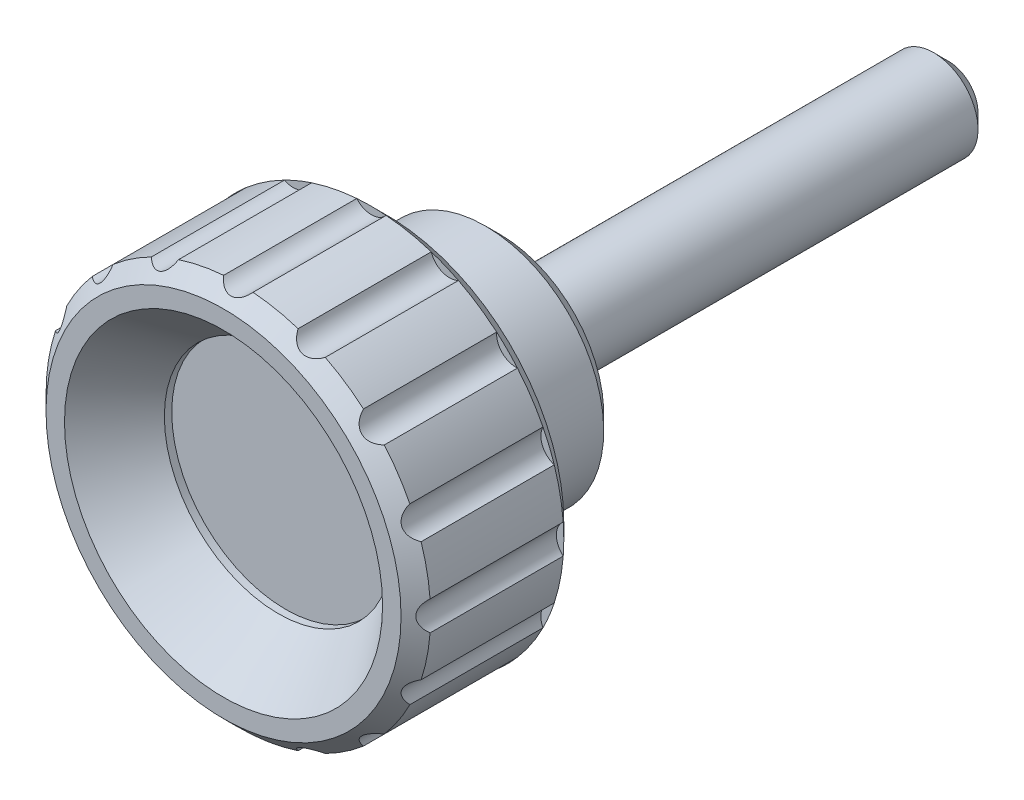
ISO-10303-21;
HEADER;
FILE_DESCRIPTION(('STEP AP214'),'2;1');
FILE_NAME('part.step','',(''),(''),'','','');
FILE_SCHEMA(('AUTOMOTIVE_DESIGN { 1 0 10303 214 1 1 1 1 }'));
ENDSEC;
DATA;
#1=APPLICATION_CONTEXT('core data for automotive mechanical design processes');
#2=APPLICATION_PROTOCOL_DEFINITION('international standard','automotive_design',2000,#1);
#3=PRODUCT_CONTEXT('',#1,'mechanical');
#4=PRODUCT('Part','Part','',(#3));
#5=PRODUCT_RELATED_PRODUCT_CATEGORY('part','',(#4));
#6=PRODUCT_DEFINITION_FORMATION('','',#4);
#7=PRODUCT_DEFINITION_CONTEXT('part definition',#1,'design');
#8=PRODUCT_DEFINITION('design','',#6,#7);
#9=PRODUCT_DEFINITION_SHAPE('','',#8);
#10=(LENGTH_UNIT() NAMED_UNIT(*) SI_UNIT(.MILLI.,.METRE.));
#11=(NAMED_UNIT(*) PLANE_ANGLE_UNIT() SI_UNIT($,.RADIAN.));
#12=(NAMED_UNIT(*) SI_UNIT($,.STERADIAN.) SOLID_ANGLE_UNIT());
#13=UNCERTAINTY_MEASURE_WITH_UNIT(LENGTH_MEASURE(1.E-05),#10,'distance_accuracy_value','');
#14=(GEOMETRIC_REPRESENTATION_CONTEXT(3) GLOBAL_UNCERTAINTY_ASSIGNED_CONTEXT((#13)) GLOBAL_UNIT_ASSIGNED_CONTEXT((#10,
#11,#12)) REPRESENTATION_CONTEXT('',''));
#15=CARTESIAN_POINT('',(0.,0.,0.));
#16=DIRECTION('',(0.,0.,1.));
#17=DIRECTION('',(1.,0.,0.));
#18=AXIS2_PLACEMENT_3D('',#15,#16,#17);
#19=CARTESIAN_POINT('',(-6.39920215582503E-13,-5.50485583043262E-13,7.99999999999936));
#20=DIRECTION('',(0.,0.,1.));
#21=DIRECTION('',(1.,0.,0.));
#22=AXIS2_PLACEMENT_3D('',#19,#20,#21);
#23=CYLINDRICAL_SURFACE('',#22,12.9999999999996);
#24=CARTESIAN_POINT('',(-1.43982048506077E-12,-1.23859256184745E-12,18.));
#25=DIRECTION('',(0.,0.,1.));
#26=DIRECTION('',(1.,0.,0.));
#27=AXIS2_PLACEMENT_3D('',#24,#25,#26);
#28=CIRCLE('',#27,12.9999999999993);
#29=CARTESIAN_POINT('',(-4.04215376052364,-12.3556057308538,17.9999999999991));
#30=VERTEX_POINT('',#29);
#31=CARTESIAN_POINT('',(-0.9938224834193,-12.9619565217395,17.9999999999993));
#32=VERTEX_POINT('',#31);
#33=EDGE_CURVE('E410',#30,#32,#28,.T.);
#34=ORIENTED_EDGE('',*,*,#33,.F.);
#35=DIRECTION('',(0.,0.,1.));
#36=VECTOR('',#35,1.);
#37=CARTESIAN_POINT('',(-4.04215376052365,-12.3556057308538,14.));
#38=LINE('',#37,#36);
#39=CARTESIAN_POINT('',(-4.04215376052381,-12.3556057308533,9.));
#40=VERTEX_POINT('',#39);
#41=EDGE_CURVE('E616',#30,#40,#38,.F.);
#42=ORIENTED_EDGE('',*,*,#41,.T.);
#43=CARTESIAN_POINT('',(-7.19910242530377E-13,-6.19296280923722E-13,9.));
#44=DIRECTION('',(0.,0.,1.));
#45=DIRECTION('',(1.,0.,0.));
#46=AXIS2_PLACEMENT_3D('',#43,#44,#45);
#47=CIRCLE('',#46,13.);
#48=CARTESIAN_POINT('',(-0.993822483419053,-12.9619565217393,9.));
#49=VERTEX_POINT('',#48);
#50=EDGE_CURVE('E474',#40,#49,#47,.T.);
#51=ORIENTED_EDGE('',*,*,#50,.T.);
#52=DIRECTION('',(0.,0.,1.));
#53=VECTOR('',#52,1.);
#54=CARTESIAN_POINT('',(-0.993822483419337,-12.9619565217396,14.));
#55=LINE('',#54,#53);
#56=EDGE_CURVE('E584',#49,#32,#55,.T.);
#57=ORIENTED_EDGE('',*,*,#56,.T.);
#58=EDGE_LOOP('',(#34,#42,#51,#57));
#59=FACE_BOUND('',#58,.T.);
#60=ADVANCED_FACE('F14',(#59),#23,.T.);
#61=CARTESIAN_POINT('',(-8.46274873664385,-9.86822597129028,9.));
#62=VERTEX_POINT('',#61);
#63=CARTESIAN_POINT('',(-5.87849826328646,-11.59496693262,9.));
#64=VERTEX_POINT('',#63);
#65=EDGE_CURVE('E484',#62,#64,#47,.T.);
#66=ORIENTED_EDGE('',*,*,#65,.T.);
#67=DIRECTION('',(0.,0.,1.));
#68=VECTOR('',#67,1.);
#69=CARTESIAN_POINT('',(-5.87849826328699,-11.5949669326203,14.));
#70=LINE('',#69,#68);
#71=CARTESIAN_POINT('',(-5.87849826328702,-11.5949669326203,17.999999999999));
#72=VERTEX_POINT('',#71);
#73=EDGE_CURVE('E614',#64,#72,#70,.T.);
#74=ORIENTED_EDGE('',*,*,#73,.T.);
#75=CARTESIAN_POINT('',(-8.46274873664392,-9.86822597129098,17.9999999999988));
#76=VERTEX_POINT('',#75);
#77=EDGE_CURVE('E406',#76,#72,#28,.T.);
#78=ORIENTED_EDGE('',*,*,#77,.F.);
#79=DIRECTION('',(0.,0.,1.));
#80=VECTOR('',#79,1.);
#81=CARTESIAN_POINT('',(-8.46274873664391,-9.8682259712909,14.));
#82=LINE('',#81,#80);
#83=EDGE_CURVE('E612',#76,#62,#82,.F.);
#84=ORIENTED_EDGE('',*,*,#83,.T.);
#85=EDGE_LOOP('',(#66,#74,#78,#84));
#86=FACE_BOUND('',#85,.T.);
#87=ADVANCED_FACE('F343',(#86),#23,.T.);
#88=CARTESIAN_POINT('',(-11.5949669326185,-5.87849826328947,9.));
#89=VERTEX_POINT('',#88);
#90=CARTESIAN_POINT('',(-9.86822597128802,-8.4627487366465,9.));
#91=VERTEX_POINT('',#90);
#92=EDGE_CURVE('E494',#89,#91,#47,.T.);
#93=ORIENTED_EDGE('',*,*,#92,.T.);
#94=DIRECTION('',(0.,0.,1.));
#95=VECTOR('',#94,1.);
#96=CARTESIAN_POINT('',(-9.86822597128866,-8.46274873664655,14.));
#97=LINE('',#96,#95);
#98=CARTESIAN_POINT('',(-9.86822597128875,-8.46274873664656,17.9999999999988));
#99=VERTEX_POINT('',#98);
#100=EDGE_CURVE('E610',#91,#99,#97,.T.);
#101=ORIENTED_EDGE('',*,*,#100,.T.);
#102=CARTESIAN_POINT('',(-11.5949669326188,-5.87849826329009,17.9999999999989));
#103=VERTEX_POINT('',#102);
#104=EDGE_CURVE('E402',#103,#99,#28,.T.);
#105=ORIENTED_EDGE('',*,*,#104,.F.);
#106=DIRECTION('',(0.,0.,1.));
#107=VECTOR('',#106,1.);
#108=CARTESIAN_POINT('',(-11.5949669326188,-5.87849826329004,14.));
#109=LINE('',#108,#107);
#110=EDGE_CURVE('E608',#103,#89,#109,.F.);
#111=ORIENTED_EDGE('',*,*,#110,.T.);
#112=EDGE_LOOP('',(#93,#101,#105,#111));
#113=FACE_BOUND('',#112,.T.);
#114=ADVANCED_FACE('F349',(#113),#23,.T.);
#115=CARTESIAN_POINT('',(-12.9619565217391,-0.993822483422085,9.));
#116=VERTEX_POINT('',#115);
#117=CARTESIAN_POINT('',(-12.3556057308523,-4.04215376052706,9.));
#118=VERTEX_POINT('',#117);
#119=EDGE_CURVE('E505',#116,#118,#47,.T.);
#120=ORIENTED_EDGE('',*,*,#119,.T.);
#121=DIRECTION('',(0.,0.,1.));
#122=VECTOR('',#121,1.);
#123=CARTESIAN_POINT('',(-12.3556057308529,-4.04215376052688,14.));
#124=LINE('',#123,#122);
#125=CARTESIAN_POINT('',(-12.3556057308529,-4.04215376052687,17.999999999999));
#126=VERTEX_POINT('',#125);
#127=EDGE_CURVE('E606',#118,#126,#124,.T.);
#128=ORIENTED_EDGE('',*,*,#127,.T.);
#129=CARTESIAN_POINT('',(-12.9619565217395,-0.993822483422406,17.9999999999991));
#130=VERTEX_POINT('',#129);
#131=EDGE_CURVE('E398',#130,#126,#28,.T.);
#132=ORIENTED_EDGE('',*,*,#131,.F.);
#133=DIRECTION('',(0.,0.,1.));
#134=VECTOR('',#133,1.);
#135=CARTESIAN_POINT('',(-12.9619565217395,-0.993822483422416,14.));
#136=LINE('',#135,#134);
#137=EDGE_CURVE('E604',#130,#116,#136,.F.);
#138=ORIENTED_EDGE('',*,*,#137,.T.);
#139=EDGE_LOOP('',(#120,#128,#132,#138));
#140=FACE_BOUND('',#139,.T.);
#141=ADVANCED_FACE('F1087',(#140),#23,.T.);
#142=CARTESIAN_POINT('',(-12.3556057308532,4.0421537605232,9.));
#143=VERTEX_POINT('',#142);
#144=CARTESIAN_POINT('',(-12.9619565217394,0.993822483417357,9.));
#145=VERTEX_POINT('',#144);
#146=EDGE_CURVE('E516',#143,#145,#47,.T.);
#147=ORIENTED_EDGE('',*,*,#146,.T.);
#148=DIRECTION('',(0.,0.,1.));
#149=VECTOR('',#148,1.);
#150=CARTESIAN_POINT('',(-12.9619565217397,0.993822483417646,14.));
#151=LINE('',#150,#149);
#152=CARTESIAN_POINT('',(-12.9619565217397,0.993822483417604,17.9999999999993));
#153=VERTEX_POINT('',#152);
#154=EDGE_CURVE('E602',#145,#153,#151,.T.);
#155=ORIENTED_EDGE('',*,*,#154,.T.);
#156=CARTESIAN_POINT('',(-12.3556057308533,4.04215376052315,17.9999999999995));
#157=VERTEX_POINT('',#156);
#158=EDGE_CURVE('E394',#157,#153,#28,.T.);
#159=ORIENTED_EDGE('',*,*,#158,.F.);
#160=DIRECTION('',(0.,0.,1.));
#161=VECTOR('',#160,1.);
#162=CARTESIAN_POINT('',(-12.3556057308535,4.0421537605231,14.));
#163=LINE('',#162,#161);
#164=EDGE_CURVE('E600',#157,#143,#163,.F.);
#165=ORIENTED_EDGE('',*,*,#164,.T.);
#166=EDGE_LOOP('',(#147,#155,#159,#165));
#167=FACE_BOUND('',#166,.T.);
#168=ADVANCED_FACE('F1079',(#167),#23,.T.);
#169=CARTESIAN_POINT('',(-9.86822597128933,8.46274873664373,9.));
#170=VERTEX_POINT('',#169);
#171=CARTESIAN_POINT('',(-11.5949669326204,5.87849826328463,9.));
#172=VERTEX_POINT('',#171);
#173=EDGE_CURVE('E527',#170,#172,#47,.T.);
#174=ORIENTED_EDGE('',*,*,#173,.T.);
#175=DIRECTION('',(0.,0.,1.));
#176=VECTOR('',#175,1.);
#177=CARTESIAN_POINT('',(-11.5949669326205,5.87849826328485,14.));
#178=LINE('',#177,#176);
#179=CARTESIAN_POINT('',(-11.5949669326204,5.87849826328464,17.9999999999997));
#180=VERTEX_POINT('',#179);
#181=EDGE_CURVE('E598',#172,#180,#178,.T.);
#182=ORIENTED_EDGE('',*,*,#181,.T.);
#183=CARTESIAN_POINT('',(-9.86822597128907,8.46274873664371,18.));
#184=VERTEX_POINT('',#183);
#185=EDGE_CURVE('E390',#184,#180,#28,.T.);
#186=ORIENTED_EDGE('',*,*,#185,.F.);
#187=DIRECTION('',(0.,0.,1.));
#188=VECTOR('',#187,1.);
#189=CARTESIAN_POINT('',(-9.86822597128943,8.46274873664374,14.));
#190=LINE('',#189,#188);
#191=EDGE_CURVE('E596',#184,#170,#190,.F.);
#192=ORIENTED_EDGE('',*,*,#191,.T.);
#193=EDGE_LOOP('',(#174,#182,#186,#192));
#194=FACE_BOUND('',#193,.T.);
#195=ADVANCED_FACE('F1071',(#194),#23,.T.);
#196=CARTESIAN_POINT('',(-5.87849826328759,11.5949669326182,9.));
#197=VERTEX_POINT('',#196);
#198=CARTESIAN_POINT('',(-8.46274873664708,9.86822597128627,9.));
#199=VERTEX_POINT('',#198);
#200=EDGE_CURVE('E538',#197,#199,#47,.T.);
#201=ORIENTED_EDGE('',*,*,#200,.T.);
#202=DIRECTION('',(0.,0.,1.));
#203=VECTOR('',#202,1.);
#204=CARTESIAN_POINT('',(-8.46274873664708,9.86822597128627,14.));
#205=LINE('',#204,#203);
#206=CARTESIAN_POINT('',(-8.46274873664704,9.86822597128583,18.));
#207=VERTEX_POINT('',#206);
#208=EDGE_CURVE('E594',#199,#207,#205,.T.);
#209=ORIENTED_EDGE('',*,*,#208,.T.);
#210=CARTESIAN_POINT('',(-5.87849826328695,11.5949669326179,18.0000000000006));
#211=VERTEX_POINT('',#210);
#212=EDGE_CURVE('E386',#211,#207,#28,.T.);
#213=ORIENTED_EDGE('',*,*,#212,.F.);
#214=DIRECTION('',(0.,0.,1.));
#215=VECTOR('',#214,1.);
#216=CARTESIAN_POINT('',(-5.87849826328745,11.5949669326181,14.));
#217=LINE('',#216,#215);
#218=EDGE_CURVE('E592',#211,#197,#217,.F.);
#219=ORIENTED_EDGE('',*,*,#218,.T.);
#220=EDGE_LOOP('',(#201,#209,#213,#219));
#221=FACE_BOUND('',#220,.T.);
#222=ADVANCED_FACE('F1063',(#221),#23,.T.);
#223=CARTESIAN_POINT('',(-0.993822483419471,12.961956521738,9.));
#224=VERTEX_POINT('',#223);
#225=CARTESIAN_POINT('',(-4.04215376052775,12.3556057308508,9.));
#226=VERTEX_POINT('',#225);
#227=EDGE_CURVE('E266',#224,#226,#47,.T.);
#228=ORIENTED_EDGE('',*,*,#227,.T.);
#229=DIRECTION('',(0.,0.,1.));
#230=VECTOR('',#229,1.);
#231=CARTESIAN_POINT('',(-4.04215376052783,12.3556057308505,14.));
#232=LINE('',#231,#230);
#233=CARTESIAN_POINT('',(-4.04215376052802,12.3556057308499,18.0000000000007));
#234=VERTEX_POINT('',#233);
#235=EDGE_CURVE('E558',#226,#234,#232,.T.);
#236=ORIENTED_EDGE('',*,*,#235,.T.);
#237=CARTESIAN_POINT('',(-0.993822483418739,12.9619565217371,18.0000000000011));
#238=VERTEX_POINT('',#237);
#239=EDGE_CURVE('E383',#238,#234,#28,.T.);
#240=ORIENTED_EDGE('',*,*,#239,.F.);
#241=DIRECTION('',(0.,0.,1.));
#242=VECTOR('',#241,1.);
#243=CARTESIAN_POINT('',(-0.993822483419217,12.9619565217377,14.));
#244=LINE('',#243,#242);
#245=EDGE_CURVE('E559',#238,#224,#244,.F.);
#246=ORIENTED_EDGE('',*,*,#245,.T.);
#247=EDGE_LOOP('',(#228,#236,#240,#246));
#248=FACE_BOUND('',#247,.T.);
#249=ADVANCED_FACE('F557',(#248),#23,.T.);
#250=CARTESIAN_POINT('',(0.993822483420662,-12.9619565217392,17.9999999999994));
#251=VERTEX_POINT('',#250);
#252=CARTESIAN_POINT('',(4.04215376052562,-12.3556057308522,17.9999999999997));
#253=VERTEX_POINT('',#252);
#254=EDGE_CURVE('E413',#251,#253,#28,.T.);
#255=ORIENTED_EDGE('',*,*,#254,.F.);
#256=DIRECTION('',(0.,0.,1.));
#257=VECTOR('',#256,1.);
#258=CARTESIAN_POINT('',(0.993822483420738,-12.9619565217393,14.));
#259=LINE('',#258,#257);
#260=CARTESIAN_POINT('',(0.993822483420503,-12.961956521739,9.));
#261=VERTEX_POINT('',#260);
#262=EDGE_CURVE('E586',#251,#261,#259,.F.);
#263=ORIENTED_EDGE('',*,*,#262,.T.);
#264=CARTESIAN_POINT('',(4.04215376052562,-12.3556057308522,9.));
#265=VERTEX_POINT('',#264);
#266=EDGE_CURVE('E463',#261,#265,#47,.T.);
#267=ORIENTED_EDGE('',*,*,#266,.T.);
#268=DIRECTION('',(0.,0.,1.));
#269=VECTOR('',#268,1.);
#270=CARTESIAN_POINT('',(4.04215376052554,-12.3556057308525,14.));
#271=LINE('',#270,#269);
#272=EDGE_CURVE('E580',#265,#253,#271,.T.);
#273=ORIENTED_EDGE('',*,*,#272,.T.);
#274=EDGE_LOOP('',(#255,#263,#267,#273));
#275=FACE_BOUND('',#274,.T.);
#276=ADVANCED_FACE('F1048',(#275),#23,.T.);
#277=CARTESIAN_POINT('',(5.8784982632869,-11.5949669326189,18.));
#278=VERTEX_POINT('',#277);
#279=CARTESIAN_POINT('',(8.46274873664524,-9.86822597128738,18.));
#280=VERTEX_POINT('',#279);
#281=EDGE_CURVE('E416',#278,#280,#28,.T.);
#282=ORIENTED_EDGE('',*,*,#281,.F.);
#283=DIRECTION('',(0.,0.,1.));
#284=VECTOR('',#283,1.);
#285=CARTESIAN_POINT('',(5.87849826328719,-11.5949669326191,14.));
#286=LINE('',#285,#284);
#287=CARTESIAN_POINT('',(5.87849826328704,-11.594966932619,9.));
#288=VERTEX_POINT('',#287);
#289=EDGE_CURVE('E582',#278,#288,#286,.F.);
#290=ORIENTED_EDGE('',*,*,#289,.T.);
#291=CARTESIAN_POINT('',(8.46274873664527,-9.86822597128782,9.));
#292=VERTEX_POINT('',#291);
#293=EDGE_CURVE('E453',#288,#292,#47,.T.);
#294=ORIENTED_EDGE('',*,*,#293,.T.);
#295=DIRECTION('',(0.,0.,1.));
#296=VECTOR('',#295,1.);
#297=CARTESIAN_POINT('',(8.46274873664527,-9.86822597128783,14.));
#298=LINE('',#297,#296);
#299=EDGE_CURVE('E577',#292,#280,#298,.T.);
#300=ORIENTED_EDGE('',*,*,#299,.T.);
#301=EDGE_LOOP('',(#282,#290,#294,#300));
#302=FACE_BOUND('',#301,.T.);
#303=ADVANCED_FACE('F1033',(#302),#23,.T.);
#304=CARTESIAN_POINT('',(9.86822597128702,-8.46274873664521,18.0000000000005));
#305=VERTEX_POINT('',#304);
#306=CARTESIAN_POINT('',(11.5949669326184,-5.87849826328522,18.0000000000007));
#307=VERTEX_POINT('',#306);
#308=EDGE_CURVE('E420',#305,#307,#28,.T.);
#309=ORIENTED_EDGE('',*,*,#308,.F.);
#310=DIRECTION('',(0.,0.,1.));
#311=VECTOR('',#310,1.);
#312=CARTESIAN_POINT('',(9.86822597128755,-8.46274873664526,14.));
#313=LINE('',#312,#311);
#314=CARTESIAN_POINT('',(9.86822597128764,-8.46274873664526,9.));
#315=VERTEX_POINT('',#314);
#316=EDGE_CURVE('E43',#305,#315,#313,.F.);
#317=ORIENTED_EDGE('',*,*,#316,.T.);
#318=CARTESIAN_POINT('',(11.5949669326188,-5.87849826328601,9.));
#319=VERTEX_POINT('',#318);
#320=EDGE_CURVE('E444',#315,#319,#47,.T.);
#321=ORIENTED_EDGE('',*,*,#320,.T.);
#322=DIRECTION('',(0.,0.,1.));
#323=VECTOR('',#322,1.);
#324=CARTESIAN_POINT('',(11.5949669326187,-5.87849826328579,14.));
#325=LINE('',#324,#323);
#326=EDGE_CURVE('E568',#319,#307,#325,.T.);
#327=ORIENTED_EDGE('',*,*,#326,.T.);
#328=EDGE_LOOP('',(#309,#317,#321,#327));
#329=FACE_BOUND('',#328,.T.);
#330=ADVANCED_FACE('F1027',(#329),#23,.T.);
#331=CARTESIAN_POINT('',(12.3556057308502,-4.04215376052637,18.0000000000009));
#332=VERTEX_POINT('',#331);
#333=CARTESIAN_POINT('',(12.961956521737,-0.993822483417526,18.0000000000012));
#334=VERTEX_POINT('',#333);
#335=EDGE_CURVE('E423',#332,#334,#28,.T.);
#336=ORIENTED_EDGE('',*,*,#335,.F.);
#337=DIRECTION('',(0.,0.,1.));
#338=VECTOR('',#337,1.);
#339=CARTESIAN_POINT('',(12.3556057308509,-4.04215376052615,14.));
#340=LINE('',#339,#338);
#341=CARTESIAN_POINT('',(12.3556057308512,-4.04215376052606,9.));
#342=VERTEX_POINT('',#341);
#343=EDGE_CURVE('E35',#332,#342,#340,.F.);
#344=ORIENTED_EDGE('',*,*,#343,.T.);
#345=CARTESIAN_POINT('',(12.961956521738,-0.993822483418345,9.));
#346=VERTEX_POINT('',#345);
#347=EDGE_CURVE('E434',#342,#346,#47,.T.);
#348=ORIENTED_EDGE('',*,*,#347,.T.);
#349=DIRECTION('',(0.,0.,1.));
#350=VECTOR('',#349,1.);
#351=CARTESIAN_POINT('',(12.9619565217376,-0.993822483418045,14.));
#352=LINE('',#351,#350);
#353=EDGE_CURVE('E569',#346,#334,#352,.T.);
#354=ORIENTED_EDGE('',*,*,#353,.T.);
#355=EDGE_LOOP('',(#336,#344,#348,#354));
#356=FACE_BOUND('',#355,.T.);
#357=ADVANCED_FACE('F1032',(#356),#23,.T.);
#358=CARTESIAN_POINT('',(12.9619565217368,0.993822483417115,18.0000000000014));
#359=VERTEX_POINT('',#358);
#360=CARTESIAN_POINT('',(12.3556057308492,4.04215376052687,18.0000000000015));
#361=VERTEX_POINT('',#360);
#362=EDGE_CURVE('E274',#359,#361,#28,.T.);
#363=ORIENTED_EDGE('',*,*,#362,.F.);
#364=DIRECTION('',(0.,0.,1.));
#365=VECTOR('',#364,1.);
#366=CARTESIAN_POINT('',(12.9619565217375,0.993822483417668,14.));
#367=LINE('',#366,#365);
#368=CARTESIAN_POINT('',(12.9619565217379,0.99382248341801,9.));
#369=VERTEX_POINT('',#368);
#370=EDGE_CURVE('E566',#359,#369,#367,.F.);
#371=ORIENTED_EDGE('',*,*,#370,.T.);
#372=CARTESIAN_POINT('',(12.3556057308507,4.04215376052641,9.));
#373=VERTEX_POINT('',#372);
#374=EDGE_CURVE('E267',#369,#373,#47,.T.);
#375=ORIENTED_EDGE('',*,*,#374,.T.);
#376=DIRECTION('',(0.,0.,1.));
#377=VECTOR('',#376,1.);
#378=CARTESIAN_POINT('',(12.3556057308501,4.0421537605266,14.));
#379=LINE('',#378,#377);
#380=EDGE_CURVE('E565',#373,#361,#379,.T.);
#381=ORIENTED_EDGE('',*,*,#380,.T.);
#382=EDGE_LOOP('',(#363,#371,#375,#381));
#383=FACE_BOUND('',#382,.T.);
#384=ADVANCED_FACE('F372',(#383),#23,.T.);
#385=CARTESIAN_POINT('',(11.594966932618,5.87849826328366,18.0000000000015));
#386=VERTEX_POINT('',#385);
#387=CARTESIAN_POINT('',(9.86822597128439,8.46274873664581,18.0000000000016));
#388=VERTEX_POINT('',#387);
#389=EDGE_CURVE('E381',#386,#388,#28,.T.);
#390=ORIENTED_EDGE('',*,*,#389,.F.);
#391=DIRECTION('',(0.,0.,1.));
#392=VECTOR('',#391,1.);
#393=CARTESIAN_POINT('',(11.5949669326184,5.87849826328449,14.));
#394=LINE('',#393,#392);
#395=CARTESIAN_POINT('',(11.5949669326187,5.87849826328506,9.));
#396=VERTEX_POINT('',#395);
#397=EDGE_CURVE('E572',#386,#396,#394,.F.);
#398=ORIENTED_EDGE('',*,*,#397,.T.);
#399=CARTESIAN_POINT('',(9.868225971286,8.46274873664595,9.));
#400=VERTEX_POINT('',#399);
#401=EDGE_CURVE('E1164',#396,#400,#47,.T.);
#402=ORIENTED_EDGE('',*,*,#401,.T.);
#403=DIRECTION('',(0.,0.,1.));
#404=VECTOR('',#403,1.);
#405=CARTESIAN_POINT('',(9.86822597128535,8.46274873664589,14.));
#406=LINE('',#405,#404);
#407=EDGE_CURVE('E258',#400,#388,#406,.T.);
#408=ORIENTED_EDGE('',*,*,#407,.T.);
#409=EDGE_LOOP('',(#390,#398,#402,#408));
#410=FACE_BOUND('',#409,.T.);
#411=ADVANCED_FACE('F362',(#410),#23,.T.);
#412=CARTESIAN_POINT('',(8.4627487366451,9.86822597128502,18.0000000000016));
#413=VERTEX_POINT('',#412);
#414=CARTESIAN_POINT('',(5.87849826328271,11.5949669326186,18.0000000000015));
#415=VERTEX_POINT('',#414);
#416=EDGE_CURVE('E377',#413,#415,#28,.T.);
#417=ORIENTED_EDGE('',*,*,#416,.F.);
#418=DIRECTION('',(0.,0.,1.));
#419=VECTOR('',#418,1.);
#420=CARTESIAN_POINT('',(8.46274873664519,9.86822597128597,14.));
#421=LINE('',#420,#419);
#422=CARTESIAN_POINT('',(8.46274873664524,9.86822597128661,9.));
#423=VERTEX_POINT('',#422);
#424=EDGE_CURVE('E378',#413,#423,#421,.F.);
#425=ORIENTED_EDGE('',*,*,#424,.T.);
#426=CARTESIAN_POINT('',(5.87849826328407,11.5949669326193,9.));
#427=VERTEX_POINT('',#426);
#428=EDGE_CURVE('E239',#423,#427,#47,.T.);
#429=ORIENTED_EDGE('',*,*,#428,.T.);
#430=DIRECTION('',(0.,0.,1.));
#431=VECTOR('',#430,1.);
#432=CARTESIAN_POINT('',(5.87849826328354,11.594966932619,14.));
#433=LINE('',#432,#431);
#434=EDGE_CURVE('E248',#427,#415,#433,.T.);
#435=ORIENTED_EDGE('',*,*,#434,.T.);
#436=EDGE_LOOP('',(#417,#425,#429,#435));
#437=FACE_BOUND('',#436,.T.);
#438=ADVANCED_FACE('F354',(#437),#23,.T.);
#439=CARTESIAN_POINT('',(10.2499999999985,-1.30740325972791E-12,19.0000000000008));
#440=DIRECTION('',(0.,0.,1.));
#441=DIRECTION('',(0.,-1.,0.));
#442=AXIS2_PLACEMENT_3D('',#439,#440,#441);
#443=PLANE('',#442);
#444=CARTESIAN_POINT('',(-1.51981051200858E-12,-1.30740325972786E-12,19.));
#445=DIRECTION('',(0.,0.,1.));
#446=DIRECTION('',(1.,0.,0.));
#447=AXIS2_PLACEMENT_3D('',#444,#445,#446);
#448=CIRCLE('',#447,11.9999999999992);
#449=CARTESIAN_POINT('',(11.9999999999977,-1.30740325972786E-12,19.000000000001));
#450=VERTEX_POINT('',#449);
#451=EDGE_CURVE('E426',#450,#450,#448,.T.);
#452=ORIENTED_EDGE('',*,*,#451,.T.);
#453=EDGE_LOOP('',(#452));
#454=FACE_BOUND('',#453,.T.);
#455=CARTESIAN_POINT('',(-1.51981051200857E-12,-1.30740325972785E-12,19.));
#456=DIRECTION('',(0.,0.,1.));
#457=DIRECTION('',(1.,0.,0.));
#458=AXIS2_PLACEMENT_3D('',#455,#456,#457);
#459=CIRCLE('',#458,10.75);
#460=CARTESIAN_POINT('',(10.7499999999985,-1.30740325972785E-12,19.0000000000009));
#461=VERTEX_POINT('',#460);
#462=EDGE_CURVE('E430',#461,#461,#459,.T.);
#463=ORIENTED_EDGE('',*,*,#462,.F.);
#464=EDGE_LOOP('',(#463));
#465=FACE_BOUND('',#464,.T.);
#466=ADVANCED_FACE('F361',(#454,#465),#443,.T.);
#467=CARTESIAN_POINT('',(7.,0.,0.30000000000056));
#468=DIRECTION('',(0.,0.,-1.));
#469=DIRECTION('',(0.,1.,0.));
#470=AXIS2_PLACEMENT_3D('',#467,#468,#469);
#471=PLANE('',#470);
#472=CARTESIAN_POINT('',(0.,0.,0.3));
#473=DIRECTION('',(0.,0.,-1.));
#474=DIRECTION('',(-1.,0.,0.));
#475=AXIS2_PLACEMENT_3D('',#472,#473,#474);
#476=CIRCLE('',#475,4.8);
#477=CARTESIAN_POINT('',(-4.80000000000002,0.,0.299999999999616));
#478=VERTEX_POINT('',#477);
#479=EDGE_CURVE('E302',#478,#478,#476,.T.);
#480=ORIENTED_EDGE('',*,*,#479,.F.);
#481=EDGE_LOOP('',(#480));
#482=FACE_BOUND('',#481,.T.);
#483=CARTESIAN_POINT('',(0.,0.,0.3));
#484=DIRECTION('',(0.,0.,-1.));
#485=DIRECTION('',(0.,1.,0.));
#486=AXIS2_PLACEMENT_3D('',#483,#484,#485);
#487=CIRCLE('',#486,7.);
#488=CARTESIAN_POINT('',(0.,6.99999999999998,0.300000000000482));
#489=VERTEX_POINT('',#488);
#490=EDGE_CURVE('E284',#489,#489,#487,.T.);
#491=ORIENTED_EDGE('',*,*,#490,.T.);
#492=EDGE_LOOP('',(#491));
#493=FACE_BOUND('',#492,.T.);
#494=ADVANCED_FACE('F369',(#482,#493),#471,.T.);
#495=CARTESIAN_POINT('',(11.4999999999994,-5.50485583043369E-13,8.00000000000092));
#496=DIRECTION('',(0.,0.,-1.));
#497=DIRECTION('',(0.,1.,0.));
#498=AXIS2_PLACEMENT_3D('',#495,#496,#497);
#499=PLANE('',#498);
#500=CARTESIAN_POINT('',(-6.39920215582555E-13,-5.50485583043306E-13,8.));
#501=DIRECTION('',(0.,0.,-1.));
#502=DIRECTION('',(0.,1.,0.));
#503=AXIS2_PLACEMENT_3D('',#500,#501,#502);
#504=CIRCLE('',#503,8.);
#505=CARTESIAN_POINT('',(-6.39920215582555E-13,7.99999999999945,8.00000000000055));
#506=VERTEX_POINT('',#505);
#507=EDGE_CURVE('E290',#506,#506,#504,.T.);
#508=ORIENTED_EDGE('',*,*,#507,.F.);
#509=EDGE_LOOP('',(#508));
#510=FACE_BOUND('',#509,.T.);
#511=CARTESIAN_POINT('',(-6.39920215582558E-13,-5.50485583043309E-13,8.));
#512=DIRECTION('',(0.,0.,1.));
#513=DIRECTION('',(1.,0.,0.));
#514=AXIS2_PLACEMENT_3D('',#511,#512,#513);
#515=CIRCLE('',#514,12.);
#516=CARTESIAN_POINT('',(11.9999999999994,-5.50485583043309E-13,8.00000000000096));
#517=VERTEX_POINT('',#516);
#518=EDGE_CURVE('E271',#517,#517,#515,.T.);
#519=ORIENTED_EDGE('',*,*,#518,.F.);
#520=EDGE_LOOP('',(#519));
#521=FACE_BOUND('',#520,.T.);
#522=ADVANCED_FACE('F633',(#510,#521),#499,.T.);
#523=CARTESIAN_POINT('',(0.,0.,0.3));
#524=DIRECTION('',(0.,0.,-1.));
#525=DIRECTION('',(0.,1.,0.));
#526=AXIS2_PLACEMENT_3D('',#523,#524,#525);
#527=CYLINDRICAL_SURFACE('',#526,8.);
#528=ORIENTED_EDGE('',*,*,#507,.T.);
#529=EDGE_LOOP('',(#528));
#530=FACE_BOUND('',#529,.T.);
#531=CARTESIAN_POINT('',(-1.03987035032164E-13,0.,1.3));
#532=DIRECTION('',(0.,0.,-1.));
#533=DIRECTION('',(0.,1.,0.));
#534=AXIS2_PLACEMENT_3D('',#531,#532,#533);
#535=CIRCLE('',#534,8.);
#536=CARTESIAN_POINT('',(-1.03987035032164E-13,7.99999999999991,1.30000000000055));
#537=VERTEX_POINT('',#536);
#538=EDGE_CURVE('E287',#537,#537,#535,.T.);
#539=ORIENTED_EDGE('',*,*,#538,.F.);
#540=EDGE_LOOP('',(#539));
#541=FACE_BOUND('',#540,.T.);
#542=ADVANCED_FACE('F636',(#530,#541),#527,.T.);
#543=CARTESIAN_POINT('',(0.,0.,0.3));
#544=DIRECTION('',(0.,0.,1.));
#545=DIRECTION('',(0.,-1.,0.));
#546=AXIS2_PLACEMENT_3D('',#543,#544,#545);
#547=CONICAL_SURFACE('',#546,7.,0.785398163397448);
#548=ORIENTED_EDGE('',*,*,#538,.T.);
#549=EDGE_LOOP('',(#548));
#550=FACE_BOUND('',#549,.T.);
#551=ORIENTED_EDGE('',*,*,#490,.F.);
#552=EDGE_LOOP('',(#551));
#553=FACE_BOUND('',#552,.T.);
#554=ADVANCED_FACE('F640',(#550,#553),#547,.T.);
#555=CARTESIAN_POINT('',(-1.10997762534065E-12,-9.54848222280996E-13,13.8764501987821));
#556=DIRECTION('',(0.,0.,-1.));
#557=DIRECTION('',(-1.,0.,0.));
#558=AXIS2_PLACEMENT_3D('',#555,#556,#557);
#559=CYLINDRICAL_SURFACE('',#558,4.8);
#560=ORIENTED_EDGE('',*,*,#479,.T.);
#561=EDGE_LOOP('',(#560));
#562=FACE_BOUND('',#561,.T.);
#563=CARTESIAN_POINT('',(0.,0.,0.));
#564=DIRECTION('',(0.,0.,-1.));
#565=DIRECTION('',(-1.,0.,0.));
#566=AXIS2_PLACEMENT_3D('',#563,#564,#565);
#567=CIRCLE('',#566,4.8);
#568=CARTESIAN_POINT('',(-4.8,0.,-3.83952129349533E-13));
#569=VERTEX_POINT('',#568);
#570=EDGE_CURVE('E278',#569,#569,#567,.T.);
#571=ORIENTED_EDGE('',*,*,#570,.F.);
#572=EDGE_LOOP('',(#571));
#573=FACE_BOUND('',#572,.T.);
#574=ADVANCED_FACE('F644',(#562,#573),#559,.T.);
#575=CARTESIAN_POINT('',(2.39970080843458E-12,2.0643209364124E-12,-30.));
#576=DIRECTION('',(0.,0.,-1.));
#577=DIRECTION('',(-1.,0.,0.));
#578=AXIS2_PLACEMENT_3D('',#575,#576,#577);
#579=PLANE('',#578);
#580=CARTESIAN_POINT('',(2.39970080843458E-12,2.0643209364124E-12,-30.));
#581=DIRECTION('',(0.,0.,-1.));
#582=DIRECTION('',(-1.,0.,0.));
#583=AXIS2_PLACEMENT_3D('',#580,#581,#582);
#584=CIRCLE('',#583,2.);
#585=CARTESIAN_POINT('',(-1.9999999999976,2.0643209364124E-12,-30.0000000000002));
#586=VERTEX_POINT('',#585);
#587=EDGE_CURVE('E296',#586,#586,#584,.T.);
#588=ORIENTED_EDGE('',*,*,#587,.T.);
#589=EDGE_LOOP('',(#588));
#590=FACE_BOUND('',#589,.T.);
#591=ADVANCED_FACE('F656',(#590),#579,.T.);
#592=CARTESIAN_POINT('',(2.39970080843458E-12,2.0643209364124E-12,-30.));
#593=DIRECTION('',(0.,0.,1.));
#594=DIRECTION('',(1.,0.,0.));
#595=AXIS2_PLACEMENT_3D('',#592,#593,#594);
#596=CONICAL_SURFACE('',#595,2.,0.785398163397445);
#597=CARTESIAN_POINT('',(2.31971078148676E-12,1.99551023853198E-12,-29.));
#598=DIRECTION('',(0.,0.,-1.));
#599=DIRECTION('',(-1.,0.,0.));
#600=AXIS2_PLACEMENT_3D('',#597,#598,#599);
#601=CIRCLE('',#600,3.);
#602=CARTESIAN_POINT('',(-2.99999999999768,1.99551023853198E-12,-29.0000000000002));
#603=VERTEX_POINT('',#602);
#604=EDGE_CURVE('E299',#603,#603,#601,.F.);
#605=ORIENTED_EDGE('',*,*,#604,.F.);
#606=EDGE_LOOP('',(#605));
#607=FACE_BOUND('',#606,.T.);
#608=ORIENTED_EDGE('',*,*,#587,.F.);
#609=EDGE_LOOP('',(#608));
#610=FACE_BOUND('',#609,.T.);
#611=ADVANCED_FACE('F16',(#607,#610),#596,.T.);
#612=CARTESIAN_POINT('',(2.39970080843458E-12,2.0643209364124E-12,-30.));
#613=DIRECTION('',(0.,0.,1.));
#614=DIRECTION('',(1.,0.,0.));
#615=AXIS2_PLACEMENT_3D('',#612,#613,#614);
#616=CYLINDRICAL_SURFACE('',#615,3.);
#617=ORIENTED_EDGE('',*,*,#604,.T.);
#618=EDGE_LOOP('',(#617));
#619=FACE_BOUND('',#618,.T.);
#620=CARTESIAN_POINT('',(0.,0.,0.));
#621=DIRECTION('',(0.,0.,-1.));
#622=DIRECTION('',(-1.,0.,0.));
#623=AXIS2_PLACEMENT_3D('',#620,#621,#622);
#624=CIRCLE('',#623,3.);
#625=CARTESIAN_POINT('',(-3.,0.,-2.39970080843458E-13));
#626=VERTEX_POINT('',#625);
#627=EDGE_CURVE('E281',#626,#626,#624,.T.);
#628=ORIENTED_EDGE('',*,*,#627,.T.);
#629=EDGE_LOOP('',(#628));
#630=FACE_BOUND('',#629,.T.);
#631=ADVANCED_FACE('F651',(#619,#630),#616,.T.);
#632=CARTESIAN_POINT('',(0.,0.,0.));
#633=DIRECTION('',(0.,0.,-1.));
#634=DIRECTION('',(-1.,0.,0.));
#635=AXIS2_PLACEMENT_3D('',#632,#633,#634);
#636=PLANE('',#635);
#637=ORIENTED_EDGE('',*,*,#627,.F.);
#638=EDGE_LOOP('',(#637));
#639=FACE_BOUND('',#638,.T.);
#640=ORIENTED_EDGE('',*,*,#570,.T.);
#641=EDGE_LOOP('',(#640));
#642=FACE_BOUND('',#641,.T.);
#643=ADVANCED_FACE('F359',(#639,#642),#636,.T.);
#644=CARTESIAN_POINT('',(-6.39920215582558E-13,-5.50485583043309E-13,8.));
#645=DIRECTION('',(0.,0.,1.));
#646=DIRECTION('',(1.,0.,0.));
#647=AXIS2_PLACEMENT_3D('',#644,#645,#646);
#648=CONICAL_SURFACE('',#647,12.,0.785398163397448);
#649=ORIENTED_EDGE('',*,*,#374,.F.);
#650=EDGE_CURVE('E273',#346,#369,#47,.T.);
#651=ORIENTED_EDGE('',*,*,#650,.F.);
#652=ORIENTED_EDGE('',*,*,#347,.F.);
#653=EDGE_CURVE('E440',#319,#342,#47,.T.);
#654=ORIENTED_EDGE('',*,*,#653,.F.);
#655=ORIENTED_EDGE('',*,*,#320,.F.);
#656=EDGE_CURVE('E449',#292,#315,#47,.T.);
#657=ORIENTED_EDGE('',*,*,#656,.F.);
#658=ORIENTED_EDGE('',*,*,#293,.F.);
#659=EDGE_CURVE('E458',#265,#288,#47,.T.);
#660=ORIENTED_EDGE('',*,*,#659,.F.);
#661=ORIENTED_EDGE('',*,*,#266,.F.);
#662=EDGE_CURVE('E469',#49,#261,#47,.T.);
#663=ORIENTED_EDGE('',*,*,#662,.F.);
#664=ORIENTED_EDGE('',*,*,#50,.F.);
#665=EDGE_CURVE('E480',#64,#40,#47,.T.);
#666=ORIENTED_EDGE('',*,*,#665,.F.);
#667=ORIENTED_EDGE('',*,*,#65,.F.);
#668=EDGE_CURVE('E490',#91,#62,#47,.T.);
#669=ORIENTED_EDGE('',*,*,#668,.F.);
#670=ORIENTED_EDGE('',*,*,#92,.F.);
#671=EDGE_CURVE('E500',#118,#89,#47,.T.);
#672=ORIENTED_EDGE('',*,*,#671,.F.);
#673=ORIENTED_EDGE('',*,*,#119,.F.);
#674=EDGE_CURVE('E511',#145,#116,#47,.T.);
#675=ORIENTED_EDGE('',*,*,#674,.F.);
#676=ORIENTED_EDGE('',*,*,#146,.F.);
#677=EDGE_CURVE('E522',#172,#143,#47,.T.);
#678=ORIENTED_EDGE('',*,*,#677,.F.);
#679=ORIENTED_EDGE('',*,*,#173,.F.);
#680=EDGE_CURVE('E533',#199,#170,#47,.T.);
#681=ORIENTED_EDGE('',*,*,#680,.F.);
#682=ORIENTED_EDGE('',*,*,#200,.F.);
#683=EDGE_CURVE('E544',#226,#197,#47,.T.);
#684=ORIENTED_EDGE('',*,*,#683,.F.);
#685=ORIENTED_EDGE('',*,*,#227,.F.);
#686=CARTESIAN_POINT('',(0.993822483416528,12.9619565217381,9.));
#687=VERTEX_POINT('',#686);
#688=EDGE_CURVE('E265',#687,#224,#47,.T.);
#689=ORIENTED_EDGE('',*,*,#688,.F.);
#690=CARTESIAN_POINT('',(4.04215376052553,12.355605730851,9.));
#691=VERTEX_POINT('',#690);
#692=EDGE_CURVE('E240',#691,#687,#47,.T.);
#693=ORIENTED_EDGE('',*,*,#692,.F.);
#694=EDGE_CURVE('E231',#427,#691,#47,.T.);
#695=ORIENTED_EDGE('',*,*,#694,.F.);
#696=ORIENTED_EDGE('',*,*,#428,.F.);
#697=EDGE_CURVE('E1167',#400,#423,#47,.T.);
#698=ORIENTED_EDGE('',*,*,#697,.F.);
#699=ORIENTED_EDGE('',*,*,#401,.F.);
#700=EDGE_CURVE('E272',#373,#396,#47,.T.);
#701=ORIENTED_EDGE('',*,*,#700,.F.);
#702=EDGE_LOOP('',(#649,#651,#652,#654,#655,#657,#658,#660,#661,#663,#664,#666,#667,#669,#670,
#672,#673,#675,#676,#678,#679,#681,#682,#684,#685,#689,#693,#695,#696,#698,#699,#701));
#703=FACE_BOUND('',#702,.T.);
#704=ORIENTED_EDGE('',*,*,#518,.T.);
#705=EDGE_LOOP('',(#704));
#706=FACE_BOUND('',#705,.T.);
#707=ADVANCED_FACE('F262',(#703,#706),#648,.T.);
#708=ORIENTED_EDGE('',*,*,#692,.T.);
#709=DIRECTION('',(0.,0.,1.));
#710=VECTOR('',#709,1.);
#711=CARTESIAN_POINT('',(0.993822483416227,12.9619565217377,14.));
#712=LINE('',#711,#710);
#713=CARTESIAN_POINT('',(0.993822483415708,12.9619565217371,18.0000000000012));
#714=VERTEX_POINT('',#713);
#715=EDGE_CURVE('E588',#687,#714,#712,.T.);
#716=ORIENTED_EDGE('',*,*,#715,.T.);
#717=CARTESIAN_POINT('',(4.04215376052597,12.3556057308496,18.0000000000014));
#718=VERTEX_POINT('',#717);
#719=EDGE_CURVE('E257',#718,#714,#28,.T.);
#720=ORIENTED_EDGE('',*,*,#719,.F.);
#721=DIRECTION('',(0.,0.,1.));
#722=VECTOR('',#721,1.);
#723=CARTESIAN_POINT('',(4.0421537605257,12.3556057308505,14.));
#724=LINE('',#723,#722);
#725=EDGE_CURVE('E245',#718,#691,#724,.F.);
#726=ORIENTED_EDGE('',*,*,#725,.T.);
#727=EDGE_LOOP('',(#708,#716,#720,#726));
#728=FACE_BOUND('',#727,.T.);
#729=ADVANCED_FACE('F254',(#728),#23,.T.);
#730=CARTESIAN_POINT('',(-1.43982048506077E-12,-1.23859256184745E-12,18.));
#731=DIRECTION('',(0.,0.,-1.));
#732=DIRECTION('',(-1.,0.,0.));
#733=AXIS2_PLACEMENT_3D('',#730,#731,#732);
#734=CONICAL_SURFACE('',#733,12.9999999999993,0.785398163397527);
#735=ORIENTED_EDGE('',*,*,#451,.F.);
#736=EDGE_LOOP('',(#735));
#737=FACE_BOUND('',#736,.T.);
#738=ORIENTED_EDGE('',*,*,#77,.T.);
#739=CARTESIAN_POINT('',(-5.87871711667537,-11.5950802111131,17.9997999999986));
#740=CARTESIAN_POINT('',(-5.8492859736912,-11.5798521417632,18.0266898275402));
#741=CARTESIAN_POINT('',(-5.81895371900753,-11.5655672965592,18.0531049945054));
#742=CARTESIAN_POINT('',(-5.756371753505,-11.5390770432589,18.1048217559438));
#743=CARTESIAN_POINT('',(-5.72411817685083,-11.52687603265,18.130120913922));
#744=CARTESIAN_POINT('',(-5.62378947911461,-11.4935463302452,18.2044510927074));
#745=CARTESIAN_POINT('',(-5.55276752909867,-11.4760237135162,18.2513352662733));
#746=CARTESIAN_POINT('',(-5.42531861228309,-11.4564586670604,18.3239368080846));
#747=CARTESIAN_POINT('',(-5.37060424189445,-11.4514062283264,18.3518558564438));
#748=CARTESIAN_POINT('',(-5.25848601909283,-11.4485329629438,18.4016637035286));
#749=CARTESIAN_POINT('',(-5.2010949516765,-11.4506806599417,18.4235782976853));
#750=CARTESIAN_POINT('',(-5.09393831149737,-11.4621269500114,18.4570191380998));
#751=CARTESIAN_POINT('',(-5.04439157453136,-11.4702488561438,18.469636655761));
#752=CARTESIAN_POINT('',(-4.94543096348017,-11.4925807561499,18.4886362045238));
#753=CARTESIAN_POINT('',(-4.89601708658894,-11.5067906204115,18.4950183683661));
#754=CARTESIAN_POINT('',(-4.79873736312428,-11.5412079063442,18.5010119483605));
#755=CARTESIAN_POINT('',(-4.75087591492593,-11.5614309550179,18.5006055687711));
#756=CARTESIAN_POINT('',(-4.65835169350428,-11.6071997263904,18.4930150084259));
#757=CARTESIAN_POINT('',(-4.61368935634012,-11.632746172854,18.4858299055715));
#758=CARTESIAN_POINT('',(-4.53038775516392,-11.6870353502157,18.4656900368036));
#759=CARTESIAN_POINT('',(-4.49158013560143,-11.7156116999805,18.4529747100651));
#760=CARTESIAN_POINT('',(-4.41848432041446,-11.775752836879,18.4226654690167));
#761=CARTESIAN_POINT('',(-4.38419765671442,-11.8073186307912,18.4050699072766));
#762=CARTESIAN_POINT('',(-4.30512735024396,-11.8880598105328,18.3565675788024));
#763=CARTESIAN_POINT('',(-4.26307152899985,-11.9384900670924,18.3233046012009));
#764=CARTESIAN_POINT('',(-4.18858929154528,-12.0419659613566,18.2504718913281));
#765=CARTESIAN_POINT('',(-4.15619325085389,-12.0950192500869,18.2108828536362));
#766=CARTESIAN_POINT('',(-4.11040101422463,-12.1828671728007,18.1424390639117));
#767=CARTESIAN_POINT('',(-4.09436816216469,-12.2173373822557,18.1148701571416));
#768=CARTESIAN_POINT('',(-4.06572380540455,-12.2864807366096,18.0583181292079));
#769=CARTESIAN_POINT('',(-4.05310887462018,-12.3211536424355,18.0293364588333));
#770=CARTESIAN_POINT('',(-4.0420791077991,-12.355840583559,17.9997999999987));
#771=B_SPLINE_CURVE_WITH_KNOTS('',3,(#739,#740,#741,#742,#743,#744,#745,#746,#747,#748,#749,
#750,#751,#752,#753,#754,#755,#756,#757,#758,#759,#760,#761,#762,#763,#764,#765,#766,#767,#768,
#769,#770),.UNSPECIFIED.,.F.,.F.,(4,2,2,2,2,2,2,2,2,2,2,2,2,2,2,4),(0.,0.127963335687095,
0.256193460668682,0.515365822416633,0.699649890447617,0.883129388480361,1.03777780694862,
1.19242293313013,1.34747351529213,1.50254519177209,1.65148353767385,1.80047222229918,
2.0200815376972,2.2403743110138,2.38112116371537,2.52172640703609),.UNSPECIFIED.);
#772=EDGE_CURVE('E9',#72,#30,#771,.T.);
#773=ORIENTED_EDGE('',*,*,#772,.T.);
#774=ORIENTED_EDGE('',*,*,#33,.T.);
#775=CARTESIAN_POINT('',(-0.993981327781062,-12.962144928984,17.9998000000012));
#776=CARTESIAN_POINT('',(-0.972618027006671,-12.9368132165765,18.0266898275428));
#777=CARTESIAN_POINT('',(-0.95006125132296,-12.9120080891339,18.0531049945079));
#778=CARTESIAN_POINT('',(-0.902380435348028,-12.8635852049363,18.104821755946));
#779=CARTESIAN_POINT('',(-0.877251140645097,-12.8399700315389,18.1301209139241));
#780=CARTESIAN_POINT('',(-0.797314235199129,-12.7707832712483,18.2044510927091));
#781=CARTESIAN_POINT('',(-0.738404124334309,-12.7274155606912,18.2513352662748));
#782=CARTESIAN_POINT('',(-0.628143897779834,-12.6605672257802,18.3239368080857));
#783=CARTESIAN_POINT('',(-0.579527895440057,-12.6349610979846,18.3518558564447));
#784=CARTESIAN_POINT('',(-0.4770437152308,-12.589400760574,18.4016637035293));
#785=CARTESIAN_POINT('',(-0.423199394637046,-12.5694223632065,18.4235782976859));
#786=CARTESIAN_POINT('',(-0.319819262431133,-12.5389902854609,18.4570191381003));
#787=CARTESIAN_POINT('',(-0.270935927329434,-12.527533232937,18.4696366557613));
#788=CARTESIAN_POINT('',(-0.170962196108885,-12.5102946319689,18.4886362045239));
#789=CARTESIAN_POINT('',(-0.119871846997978,-12.5045129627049,18.4950183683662));
#790=CARTESIAN_POINT('',(-0.0168261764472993,-12.4990830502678,18.5010119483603));
#791=CARTESIAN_POINT('',(0.0351310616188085,-12.499450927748,18.5006055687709));
#792=CARTESIAN_POINT('',(0.138127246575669,-12.5063282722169,18.4930150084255));
#793=CARTESIAN_POINT('',(0.189166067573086,-12.5128385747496,18.485829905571));
#794=CARTESIAN_POINT('',(0.286902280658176,-12.5311170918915,18.4656900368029));
#795=CARTESIAN_POINT('',(0.333691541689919,-12.5426671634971,18.4529747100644));
#796=CARTESIAN_POINT('',(0.424238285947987,-12.5702577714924,18.4226654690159));
#797=CARTESIAN_POINT('',(0.467994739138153,-12.5862998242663,18.4050699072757));
#798=CARTESIAN_POINT('',(0.57194448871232,-12.6306360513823,18.3565675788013));
#799=CARTESIAN_POINT('',(0.63009782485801,-12.6611334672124,18.3233046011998));
#800=CARTESIAN_POINT('',(0.738508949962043,-12.7282296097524,18.2504718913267));
#801=CARTESIAN_POINT('',(0.788741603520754,-12.764847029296,18.2108828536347));
#802=CARTESIAN_POINT('',(0.864666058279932,-12.8284839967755,18.1424390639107));
#803=CARTESIAN_POINT('',(0.892669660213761,-12.8541948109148,18.1148701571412));
#804=CARTESIAN_POINT('',(0.945593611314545,-12.9071132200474,18.058318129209));
#805=CARTESIAN_POINT('',(0.970517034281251,-12.9343192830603,18.0293364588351));
#806=CARTESIAN_POINT('',(0.99398132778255,-12.9621449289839,17.9998000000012));
#807=B_SPLINE_CURVE_WITH_KNOTS('',3,(#775,#776,#777,#778,#779,#780,#781,#782,#783,#784,#785,
#786,#787,#788,#789,#790,#791,#792,#793,#794,#795,#796,#797,#798,#799,#800,#801,#802,#803,#804,
#805,#806),.UNSPECIFIED.,.F.,.F.,(4,2,2,2,2,2,2,2,2,2,2,2,2,2,2,4),(0.,0.127963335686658,
0.256193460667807,0.515365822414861,0.699649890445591,0.883129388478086,1.03777780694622,
1.19242293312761,1.34747351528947,1.5025451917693,1.6514835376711,1.80047222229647,
2.02008153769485,2.24037431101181,2.38112116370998,2.52172640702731),.UNSPECIFIED.);
#808=EDGE_CURVE('E1180',#32,#251,#807,.T.);
#809=ORIENTED_EDGE('',*,*,#808,.T.);
#810=ORIENTED_EDGE('',*,*,#254,.T.);
#811=CARTESIAN_POINT('',(4.04207910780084,-12.3558405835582,17.9997999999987));
#812=CARTESIAN_POINT('',(4.05212219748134,-12.3242617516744,18.0266898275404));
#813=CARTESIAN_POINT('',(4.06346942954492,-12.292712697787,18.0531049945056));
#814=CARTESIAN_POINT('',(4.08899012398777,-12.2297291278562,18.1048217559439));
#815=CARTESIAN_POINT('',(4.10316942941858,-12.1982949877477,18.1301209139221));
#816=CARTESIAN_POINT('',(4.1505448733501,-12.1037842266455,18.2044510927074));
#817=CARTESIAN_POINT('',(4.18837461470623,-12.0411737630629,18.2513352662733));
#818=CARTESIAN_POINT('',(4.26466003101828,-11.9372191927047,18.3239368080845));
#819=CARTESIAN_POINT('',(4.2997763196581,-11.8949576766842,18.3518558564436));
#820=CARTESIAN_POINT('',(4.37702416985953,-11.8136464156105,18.4016637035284));
#821=CARTESIAN_POINT('',(4.4191244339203,-11.774583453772,18.423578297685));
#822=CARTESIAN_POINT('',(4.5029893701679,-11.70690601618,18.4570191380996));
#823=CARTESIAN_POINT('',(4.5437672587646,-11.6776142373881,18.4696366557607));
#824=CARTESIAN_POINT('',(4.62953401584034,-11.6234295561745,18.4886362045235));
#825=CARTESIAN_POINT('',(4.674522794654,-11.5985365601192,18.4950183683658));
#826=CARTESIAN_POINT('',(4.76764664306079,-11.5540861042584,18.5010119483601));
#827=CARTESIAN_POINT('',(4.8157896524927,-11.5345428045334,18.5006055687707));
#828=CARTESIAN_POINT('',(4.91357756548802,-11.5014817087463,18.4930150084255));
#829=CARTESIAN_POINT('',(4.96322267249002,-11.4879647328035,18.485829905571));
#830=CARTESIAN_POINT('',(5.0605140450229,-11.4674498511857,18.4656900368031));
#831=CARTESIAN_POINT('',(5.10816170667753,-11.4602152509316,18.4529747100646));
#832=CARTESIAN_POINT('',(5.20237445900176,-11.4510549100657,18.4226654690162));
#833=CARTESIAN_POINT('',(5.24893917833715,-11.4491309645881,18.4050699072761));
#834=CARTESIAN_POINT('',(5.36194296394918,-11.4503124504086,18.3565675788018));
#835=CARTESIAN_POINT('',(5.42734049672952,-11.4562340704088,18.3233046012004));
#836=CARTESIAN_POINT('',(5.55317589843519,-11.4767356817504,18.2504718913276));
#837=CARTESIAN_POINT('',(5.61359769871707,-11.4913425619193,18.2108828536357));
#838=CARTESIAN_POINT('',(5.70809556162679,-11.521080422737,18.1424390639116));
#839=CARTESIAN_POINT('',(5.74380661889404,-11.534117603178,18.114870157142));
#840=CARTESIAN_POINT('',(5.81295297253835,-11.5627547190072,18.0583181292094));
#841=CARTESIAN_POINT('',(5.84639052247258,-11.578352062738,18.0293364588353));
#842=CARTESIAN_POINT('',(5.87871711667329,-11.5950802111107,17.9998000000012));
#843=B_SPLINE_CURVE_WITH_KNOTS('',3,(#811,#812,#813,#814,#815,#816,#817,#818,#819,#820,#821,
#822,#823,#824,#825,#826,#827,#828,#829,#830,#831,#832,#833,#834,#835,#836,#837,#838,#839,#840,
#841,#842),.UNSPECIFIED.,.F.,.F.,(4,2,2,2,2,2,2,2,2,2,2,2,2,2,2,4),(0.,0.127963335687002,
0.256193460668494,0.515365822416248,0.699649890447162,0.883129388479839,1.03777780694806,
1.19242293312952,1.34747351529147,1.50254519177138,1.65148353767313,1.80047222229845,
2.02008153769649,2.2403743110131,2.38112116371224,2.52172640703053),.UNSPECIFIED.);
#844=EDGE_CURVE('E1133',#253,#278,#843,.T.);
#845=ORIENTED_EDGE('',*,*,#844,.T.);
#846=ORIENTED_EDGE('',*,*,#281,.T.);
#847=CARTESIAN_POINT('',(8.46276964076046,-9.86847151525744,17.9997999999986));
#848=CARTESIAN_POINT('',(8.45996354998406,-9.83545315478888,18.0266898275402));
#849=CARTESIAN_POINT('',(8.45837372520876,-9.80196323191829,18.0531049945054));
#850=CARTESIAN_POINT('',(8.45784900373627,-9.73400765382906,18.1048217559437));
#851=CARTESIAN_POINT('',(8.45891964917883,-9.69954010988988,18.1301209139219));
#852=CARTESIAN_POINT('',(8.46652114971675,-9.59409375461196,18.2044510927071));
#853=CARTESIAN_POINT('',(8.47751128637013,-9.52177241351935,18.251335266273));
#854=CARTESIAN_POINT('',(8.50820812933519,-9.3965377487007,18.3239368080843));
#855=CARTESIAN_POINT('',(8.52447856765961,-9.34405477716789,18.3518558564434));
#856=CARTESIAN_POINT('',(8.56472980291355,-9.23937149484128,18.4016637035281));
#857=CARTESIAN_POINT('',(8.58867662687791,-9.18717095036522,18.4235782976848));
#858=CARTESIAN_POINT('',(8.64025869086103,-9.09255142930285,18.4570191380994));
#859=CARTESIAN_POINT('',(8.66672306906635,-9.04988433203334,18.4696366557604));
#860=CARTESIAN_POINT('',(8.72522564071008,-8.96700269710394,18.4886362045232));
#861=CARTESIAN_POINT('',(8.75726371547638,-8.92678810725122,18.4950183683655));
#862=CARTESIAN_POINT('',(8.8262884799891,-8.85008428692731,18.5010119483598));
#863=CARTESIAN_POINT('',(8.86328792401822,-8.81360510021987,18.5006055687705));
#864=CARTESIAN_POINT('',(8.94098024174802,-8.7456388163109,18.4930150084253));
#865=CARTESIAN_POINT('',(8.9816736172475,-8.71415239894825,18.4858299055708));
#866=CARTESIAN_POINT('',(9.06370841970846,-8.65796732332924,18.4656900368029));
#867=CARTESIAN_POINT('',(9.10496055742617,-8.63304945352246,18.4529747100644));
#868=CARTESIAN_POINT('',(9.18849628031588,-8.58853274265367,18.4226654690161));
#869=CARTESIAN_POINT('',(9.23078020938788,-8.56893570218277,18.405069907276));
#870=CARTESIAN_POINT('',(9.33563422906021,-8.52678257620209,18.3565675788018));
#871=CARTESIAN_POINT('',(9.3983197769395,-8.50722688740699,18.3233046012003));
#872=CARTESIAN_POINT('',(9.52242215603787,-8.47801278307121,18.2504718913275));
#873=CARTESIAN_POINT('',(9.58383443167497,-8.4683853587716,18.2108828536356));
#874=CARTESIAN_POINT('',(9.68251925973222,-8.45969679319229,18.1424390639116));
#875=CARTESIAN_POINT('',(9.72050108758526,-8.4580755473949,18.1148701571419));
#876=CARTESIAN_POINT('',(9.7953429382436,-8.45807162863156,18.0583181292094));
#877=CARTESIAN_POINT('',(9.83220405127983,-8.45968569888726,18.0293364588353));
#878=CARTESIAN_POINT('',(9.86847151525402,-8.46276964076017,17.9998000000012));
#879=B_SPLINE_CURVE_WITH_KNOTS('',3,(#847,#848,#849,#850,#851,#852,#853,#854,#855,#856,#857,
#858,#859,#860,#861,#862,#863,#864,#865,#866,#867,#868,#869,#870,#871,#872,#873,#874,#875,#876,
#877,#878),.UNSPECIFIED.,.F.,.F.,(4,2,2,2,2,2,2,2,2,2,2,2,2,2,2,4),(0.,0.127963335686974,
0.256193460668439,0.515365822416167,0.699649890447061,0.88312938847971,1.03777780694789,
1.19242293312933,1.34747351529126,1.50254519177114,1.65148353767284,1.80047222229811,
2.02008153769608,2.24037431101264,2.38112116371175,2.52172640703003),.UNSPECIFIED.);
#880=EDGE_CURVE('E1207',#280,#305,#879,.T.);
#881=ORIENTED_EDGE('',*,*,#880,.T.);
#882=ORIENTED_EDGE('',*,*,#308,.T.);
#883=CARTESIAN_POINT('',(11.5950802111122,-5.87871711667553,17.9997999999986));
#884=CARTESIAN_POINT('',(11.5798521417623,-5.84928597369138,18.0266898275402));
#885=CARTESIAN_POINT('',(11.5655672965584,-5.81895371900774,18.0531049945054));
#886=CARTESIAN_POINT('',(11.5390770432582,-5.75637175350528,18.1048217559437));
#887=CARTESIAN_POINT('',(11.5268760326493,-5.72411817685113,18.1301209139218));
#888=CARTESIAN_POINT('',(11.4935463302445,-5.62378947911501,18.2044510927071));
#889=CARTESIAN_POINT('',(11.4760237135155,-5.55276752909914,18.2513352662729));
#890=CARTESIAN_POINT('',(11.4564586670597,-5.42531861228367,18.3239368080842));
#891=CARTESIAN_POINT('',(11.4514062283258,-5.37060424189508,18.3518558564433));
#892=CARTESIAN_POINT('',(11.4485329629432,-5.25848601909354,18.401663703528));
#893=CARTESIAN_POINT('',(11.4506806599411,-5.20109495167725,18.4235782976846));
#894=CARTESIAN_POINT('',(11.4621269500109,-5.09393831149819,18.4570191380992));
#895=CARTESIAN_POINT('',(11.4702488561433,-5.04439157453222,18.4696366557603));
#896=CARTESIAN_POINT('',(11.4925807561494,-4.94543096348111,18.4886362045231));
#897=CARTESIAN_POINT('',(11.506790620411,-4.89601708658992,18.4950183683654));
#898=CARTESIAN_POINT('',(11.5412079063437,-4.79873736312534,18.5010119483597));
#899=CARTESIAN_POINT('',(11.5614309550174,-4.75087591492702,18.5006055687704));
#900=CARTESIAN_POINT('',(11.6071997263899,-4.65835169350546,18.4930150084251));
#901=CARTESIAN_POINT('',(11.6327461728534,-4.61368935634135,18.4858299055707));
#902=CARTESIAN_POINT('',(11.6870353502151,-4.53038775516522,18.4656900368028));
#903=CARTESIAN_POINT('',(11.71561169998,-4.49158013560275,18.4529747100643));
#904=CARTESIAN_POINT('',(11.7757528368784,-4.41848432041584,18.4226654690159));
#905=CARTESIAN_POINT('',(11.8073186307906,-4.38419765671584,18.4050699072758));
#906=CARTESIAN_POINT('',(11.8880598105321,-4.30512735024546,18.3565675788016));
#907=CARTESIAN_POINT('',(11.9384900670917,-4.26307152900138,18.3233046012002));
#908=CARTESIAN_POINT('',(12.0419659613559,-4.18858929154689,18.2504718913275));
#909=CARTESIAN_POINT('',(12.0950192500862,-4.15619325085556,18.2108828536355));
#910=CARTESIAN_POINT('',(12.1828671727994,-4.11040101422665,18.1424390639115));
#911=CARTESIAN_POINT('',(12.2173373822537,-4.09436816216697,18.1148701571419));
#912=CARTESIAN_POINT('',(12.2864807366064,-4.06572380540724,18.0583181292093));
#913=CARTESIAN_POINT('',(12.3211536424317,-4.05310887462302,18.0293364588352));
#914=CARTESIAN_POINT('',(12.3558405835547,-4.04207910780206,17.9998000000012));
#915=B_SPLINE_CURVE_WITH_KNOTS('',3,(#883,#884,#885,#886,#887,#888,#889,#890,#891,#892,#893,
#894,#895,#896,#897,#898,#899,#900,#901,#902,#903,#904,#905,#906,#907,#908,#909,#910,#911,#912,
#913,#914),.UNSPECIFIED.,.F.,.F.,(4,2,2,2,2,2,2,2,2,2,2,2,2,2,2,4),(0.,0.127963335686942,
0.256193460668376,0.51536582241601,0.699649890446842,0.883129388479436,1.03777780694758,
1.19242293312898,1.34747351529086,1.5025451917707,1.65148353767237,1.80047222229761,
2.02008153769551,2.24037431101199,2.38112116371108,2.52172640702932),.UNSPECIFIED.);
#916=EDGE_CURVE('E1213',#307,#332,#915,.T.);
#917=ORIENTED_EDGE('',*,*,#916,.T.);
#918=ORIENTED_EDGE('',*,*,#335,.T.);
#919=CARTESIAN_POINT('',(12.9621449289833,-0.993981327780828,17.9998000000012));
#920=CARTESIAN_POINT('',(12.9368132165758,-0.972618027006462,18.0266898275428));
#921=CARTESIAN_POINT('',(12.9120080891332,-0.950061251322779,18.0531049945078));
#922=CARTESIAN_POINT('',(12.8635852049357,-0.902380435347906,18.1048217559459));
#923=CARTESIAN_POINT('',(12.8399700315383,-0.877251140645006,18.1301209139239));
#924=CARTESIAN_POINT('',(12.7707832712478,-0.79731423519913,18.2044510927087));
#925=CARTESIAN_POINT('',(12.7274155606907,-0.738404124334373,18.2513352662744));
#926=CARTESIAN_POINT('',(12.6605672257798,-0.628143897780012,18.3239368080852));
#927=CARTESIAN_POINT('',(12.6349610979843,-0.579527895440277,18.3518558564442));
#928=CARTESIAN_POINT('',(12.5894007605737,-0.477043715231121,18.4016637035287));
#929=CARTESIAN_POINT('',(12.5694223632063,-0.423199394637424,18.4235782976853));
#930=CARTESIAN_POINT('',(12.5389902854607,-0.319819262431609,18.4570191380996));
#931=CARTESIAN_POINT('',(12.5275332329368,-0.270935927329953,18.4696366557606));
#932=CARTESIAN_POINT('',(12.5102946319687,-0.170962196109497,18.4886362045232));
#933=CARTESIAN_POINT('',(12.5045129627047,-0.119871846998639,18.4950183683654));
#934=CARTESIAN_POINT('',(12.4990830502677,-0.0168261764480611,18.5010119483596));
#935=CARTESIAN_POINT('',(12.4994509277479,0.0351310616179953,18.5006055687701));
#936=CARTESIAN_POINT('',(12.5063282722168,0.138127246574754,18.4930150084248));
#937=CARTESIAN_POINT('',(12.5128385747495,0.18916606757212,18.4858299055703));
#938=CARTESIAN_POINT('',(12.5311170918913,0.28690228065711,18.4656900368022));
#939=CARTESIAN_POINT('',(12.5426671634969,0.333691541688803,18.4529747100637));
#940=CARTESIAN_POINT('',(12.5702577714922,0.424238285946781,18.4226654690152));
#941=CARTESIAN_POINT('',(12.5862998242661,0.467994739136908,18.405069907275));
#942=CARTESIAN_POINT('',(12.6306360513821,0.571944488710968,18.3565675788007));
#943=CARTESIAN_POINT('',(12.6611334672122,0.630097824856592,18.3233046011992));
#944=CARTESIAN_POINT('',(12.7282296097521,0.738508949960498,18.2504718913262));
#945=CARTESIAN_POINT('',(12.7648470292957,0.788741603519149,18.2108828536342));
#946=CARTESIAN_POINT('',(12.8284839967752,0.864666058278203,18.1424390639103));
#947=CARTESIAN_POINT('',(12.8541948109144,0.892669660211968,18.1148701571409));
#948=CARTESIAN_POINT('',(12.9071132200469,0.945593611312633,18.0583181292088));
#949=CARTESIAN_POINT('',(12.9343192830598,0.970517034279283,18.029336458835));
#950=CARTESIAN_POINT('',(12.9621449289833,0.993981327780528,17.9998000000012));
#951=B_SPLINE_CURVE_WITH_KNOTS('',3,(#919,#920,#921,#922,#923,#924,#925,#926,#927,#928,#929,
#930,#931,#932,#933,#934,#935,#936,#937,#938,#939,#940,#941,#942,#943,#944,#945,#946,#947,#948,
#949,#950),.UNSPECIFIED.,.F.,.F.,(4,2,2,2,2,2,2,2,2,2,2,2,2,2,2,4),(0.,0.127963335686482,
0.256193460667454,0.515365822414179,0.699649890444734,0.883129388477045,1.03777780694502,
1.19242293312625,1.34747351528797,1.50254519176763,1.65148353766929,1.80047222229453,
2.02008153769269,2.24037431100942,2.38112116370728,2.52172640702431),.UNSPECIFIED.);
#952=EDGE_CURVE('E1253',#334,#359,#951,.T.);
#953=ORIENTED_EDGE('',*,*,#952,.T.);
#954=ORIENTED_EDGE('',*,*,#362,.T.);
#955=CARTESIAN_POINT('',(12.3558405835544,4.04207910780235,17.9998000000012));
#956=CARTESIAN_POINT('',(12.3242617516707,4.05212219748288,18.0266898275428));
#957=CARTESIAN_POINT('',(12.2927126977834,4.0634694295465,18.0531049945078));
#958=CARTESIAN_POINT('',(12.2297291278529,4.08899012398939,18.1048217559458));
#959=CARTESIAN_POINT('',(12.1982949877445,4.10316942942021,18.1301209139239));
#960=CARTESIAN_POINT('',(12.1037842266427,4.15054487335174,18.2044510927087));
#961=CARTESIAN_POINT('',(12.0411737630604,4.18837461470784,18.2513352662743));
#962=CARTESIAN_POINT('',(11.9372191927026,4.26466003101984,18.3239368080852));
#963=CARTESIAN_POINT('',(11.8949576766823,4.29977631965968,18.3518558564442));
#964=CARTESIAN_POINT('',(11.8136464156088,4.37702416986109,18.4016637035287));
#965=CARTESIAN_POINT('',(11.7745834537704,4.41912443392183,18.4235782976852));
#966=CARTESIAN_POINT('',(11.7069060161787,4.5029893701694,18.4570191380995));
#967=CARTESIAN_POINT('',(11.6776142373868,4.54376725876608,18.4696366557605));
#968=CARTESIAN_POINT('',(11.6234295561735,4.62953401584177,18.4886362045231));
#969=CARTESIAN_POINT('',(11.5985365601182,4.67452279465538,18.4950183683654));
#970=CARTESIAN_POINT('',(11.5540861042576,4.76764664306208,18.5010119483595));
#971=CARTESIAN_POINT('',(11.5345428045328,4.81578965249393,18.5006055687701));
#972=CARTESIAN_POINT('',(11.5014817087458,4.91357756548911,18.4930150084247));
#973=CARTESIAN_POINT('',(11.4879647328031,4.96322267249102,18.4858299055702));
#974=CARTESIAN_POINT('',(11.4674498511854,5.06051404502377,18.4656900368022));
#975=CARTESIAN_POINT('',(11.4602152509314,5.10816170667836,18.4529747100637));
#976=CARTESIAN_POINT('',(11.4510549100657,5.20237445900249,18.4226654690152));
#977=CARTESIAN_POINT('',(11.4491309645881,5.24893917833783,18.405069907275));
#978=CARTESIAN_POINT('',(11.4503124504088,5.36194296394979,18.3565675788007));
#979=CARTESIAN_POINT('',(11.456234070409,5.4273404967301,18.3233046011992));
#980=CARTESIAN_POINT('',(11.4767356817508,5.55317589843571,18.2504718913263));
#981=CARTESIAN_POINT('',(11.4913425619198,5.61359769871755,18.2108828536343));
#982=CARTESIAN_POINT('',(11.5210804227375,5.70809556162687,18.1424390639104));
#983=CARTESIAN_POINT('',(11.5341176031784,5.74380661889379,18.114870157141));
#984=CARTESIAN_POINT('',(11.5627547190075,5.81295297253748,18.0583181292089));
#985=CARTESIAN_POINT('',(11.5783520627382,5.84639052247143,18.029336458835));
#986=CARTESIAN_POINT('',(11.5950802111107,5.87871711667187,17.9998000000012));
#987=B_SPLINE_CURVE_WITH_KNOTS('',3,(#955,#956,#957,#958,#959,#960,#961,#962,#963,#964,#965,
#966,#967,#968,#969,#970,#971,#972,#973,#974,#975,#976,#977,#978,#979,#980,#981,#982,#983,#984,
#985,#986),.UNSPECIFIED.,.F.,.F.,(4,2,2,2,2,2,2,2,2,2,2,2,2,2,2,4),(0.,0.127963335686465,
0.256193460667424,0.51536582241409,0.699649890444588,0.883129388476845,1.03777780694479,
1.19242293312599,1.34747351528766,1.50254519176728,1.65148353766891,1.8004722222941,
2.02008153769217,2.24037431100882,2.38112116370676,2.52172640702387),.UNSPECIFIED.);
#988=EDGE_CURVE('E1261',#361,#386,#987,.T.);
#989=ORIENTED_EDGE('',*,*,#988,.T.);
#990=ORIENTED_EDGE('',*,*,#389,.T.);
#991=CARTESIAN_POINT('',(9.86847151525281,8.46276964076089,17.9998000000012));
#992=CARTESIAN_POINT('',(9.83545315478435,8.45996354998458,18.0266898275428));
#993=CARTESIAN_POINT('',(9.80196323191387,8.45837372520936,18.0531049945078));
#994=CARTESIAN_POINT('',(9.73400765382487,8.457849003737,18.1048217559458));
#995=CARTESIAN_POINT('',(9.6995401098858,8.45891964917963,18.1301209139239));
#996=CARTESIAN_POINT('',(9.59409375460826,8.46652114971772,18.2044510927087));
#997=CARTESIAN_POINT('',(9.52177241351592,8.47751128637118,18.2513352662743));
#998=CARTESIAN_POINT('',(9.39653774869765,8.50820812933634,18.3239368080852));
#999=CARTESIAN_POINT('',(9.34405477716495,8.52447856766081,18.3518558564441));
#1000=CARTESIAN_POINT('',(9.23937149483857,8.56472980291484,18.4016637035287));
#1001=CARTESIAN_POINT('',(9.18717095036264,8.58867662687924,18.4235782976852));
#1002=CARTESIAN_POINT('',(9.09255142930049,8.6402586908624,18.4570191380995));
#1003=CARTESIAN_POINT('',(9.04988433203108,8.66672306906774,18.4696366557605));
#1004=CARTESIAN_POINT('',(8.96700269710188,8.72522564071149,18.4886362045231));
#1005=CARTESIAN_POINT('',(8.92678810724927,8.7572637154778,18.4950183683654));
#1006=CARTESIAN_POINT('',(8.85008428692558,8.8262884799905,18.5010119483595));
#1007=CARTESIAN_POINT('',(8.81360510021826,8.8632879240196,18.5006055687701));
#1008=CARTESIAN_POINT('',(8.74563881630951,8.94098024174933,18.4930150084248));
#1009=CARTESIAN_POINT('',(8.71415239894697,8.98167361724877,18.4858299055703));
#1010=CARTESIAN_POINT('',(8.65796732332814,9.06370841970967,18.4656900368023));
#1011=CARTESIAN_POINT('',(8.63304945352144,9.10496055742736,18.4529747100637));
#1012=CARTESIAN_POINT('',(8.5885327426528,9.18849628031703,18.4226654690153));
#1013=CARTESIAN_POINT('',(8.56893570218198,9.23078020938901,18.4050699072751));
#1014=CARTESIAN_POINT('',(8.52678257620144,9.33563422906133,18.3565675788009));
#1015=CARTESIAN_POINT('',(8.50722688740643,9.39831977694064,18.3233046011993));
#1016=CARTESIAN_POINT('',(8.47801278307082,9.52242215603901,18.2504718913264));
#1017=CARTESIAN_POINT('',(8.46838535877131,9.5838344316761,18.2108828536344));
#1018=CARTESIAN_POINT('',(8.45969679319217,9.68251925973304,18.1424390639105));
#1019=CARTESIAN_POINT('',(8.45807554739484,9.72050108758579,18.1148701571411));
#1020=CARTESIAN_POINT('',(8.45807162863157,9.79534293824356,18.0583181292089));
#1021=CARTESIAN_POINT('',(8.45968569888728,9.83220405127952,18.029336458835));
#1022=CARTESIAN_POINT('',(8.46276964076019,9.86847151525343,17.9998000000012));
#1023=B_SPLINE_CURVE_WITH_KNOTS('',3,(#991,#992,#993,#994,#995,#996,#997,#998,#999,#1000,#1001,
#1002,#1003,#1004,#1005,#1006,#1007,#1008,#1009,#1010,#1011,#1012,#1013,#1014,#1015,#1016,#1017,
#1018,#1019,#1020,#1021,#1022),.UNSPECIFIED.,.F.,.F.,(4,2,2,2,2,2,2,2,2,2,2,2,2,2,2,4),(0.,
0.127963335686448,0.25619346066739,0.515365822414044,0.699649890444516,0.883129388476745,
1.03777780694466,1.19242293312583,1.34747351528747,1.50254519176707,1.65148353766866,
1.80047222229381,2.02008153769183,2.24037431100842,2.38112116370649,2.52172640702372),.UNSPECIFIED.);
#1024=EDGE_CURVE('E312',#388,#413,#1023,.T.);
#1025=ORIENTED_EDGE('',*,*,#1024,.T.);
#1026=ORIENTED_EDGE('',*,*,#416,.T.);
#1027=CARTESIAN_POINT('',(5.87871711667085,11.5950802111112,17.9998000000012));
#1028=CARTESIAN_POINT('',(5.84928597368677,11.5798521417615,18.0266898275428));
#1029=CARTESIAN_POINT('',(5.81895371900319,11.5655672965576,18.0531049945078));
#1030=CARTESIAN_POINT('',(5.75637175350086,11.5390770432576,18.1048217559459));
#1031=CARTESIAN_POINT('',(5.72411817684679,11.5268760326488,18.1301209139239));
#1032=CARTESIAN_POINT('',(5.62378947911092,11.4935463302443,18.2044510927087));
#1033=CARTESIAN_POINT('',(5.55276752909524,11.4760237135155,18.2513352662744));
#1034=CARTESIAN_POINT('',(5.42531861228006,11.4564586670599,18.3239368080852));
#1035=CARTESIAN_POINT('',(5.37060424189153,11.451406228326,18.3518558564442));
#1036=CARTESIAN_POINT('',(5.25848601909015,11.4485329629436,18.4016637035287));
#1037=CARTESIAN_POINT('',(5.20109495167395,11.4506806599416,18.4235782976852));
#1038=CARTESIAN_POINT('',(5.09393831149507,11.4621269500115,18.4570191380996));
#1039=CARTESIAN_POINT('',(5.04439157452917,11.4702488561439,18.4696366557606));
#1040=CARTESIAN_POINT('',(4.94543096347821,11.4925807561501,18.4886362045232));
#1041=CARTESIAN_POINT('',(4.89601708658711,11.5067906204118,18.4950183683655));
#1042=CARTESIAN_POINT('',(4.79873736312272,11.5412079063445,18.5010119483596));
#1043=CARTESIAN_POINT('',(4.7508759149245,11.5614309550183,18.5006055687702));
#1044=CARTESIAN_POINT('',(4.65835169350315,11.6071997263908,18.4930150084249));
#1045=CARTESIAN_POINT('',(4.61368935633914,11.6327461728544,18.4858299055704));
#1046=CARTESIAN_POINT('',(4.53038775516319,11.6870353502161,18.4656900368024));
#1047=CARTESIAN_POINT('',(4.49158013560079,11.7156116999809,18.4529747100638));
#1048=CARTESIAN_POINT('',(4.41848432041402,11.7757528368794,18.4226654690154));
#1049=CARTESIAN_POINT('',(4.38419765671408,11.8073186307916,18.4050699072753));
#1050=CARTESIAN_POINT('',(4.30512735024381,11.8880598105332,18.356567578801));
#1051=CARTESIAN_POINT('',(4.26307152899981,11.9384900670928,18.3233046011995));
#1052=CARTESIAN_POINT('',(4.18858929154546,12.0419659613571,18.2504718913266));
#1053=CARTESIAN_POINT('',(4.15619325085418,12.0950192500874,18.2108828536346));
#1054=CARTESIAN_POINT('',(4.11040101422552,12.1828671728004,18.1424390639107));
#1055=CARTESIAN_POINT('',(4.09436816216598,12.2173373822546,18.1148701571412));
#1056=CARTESIAN_POINT('',(4.0657238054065,12.2864807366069,18.058318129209));
#1057=CARTESIAN_POINT('',(4.05310887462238,12.3211536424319,18.0293364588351));
#1058=CARTESIAN_POINT('',(4.04207910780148,12.3558405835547,17.9998000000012));
#1059=B_SPLINE_CURVE_WITH_KNOTS('',3,(#1027,#1028,#1029,#1030,#1031,#1032,#1033,#1034,#1035,
#1036,#1037,#1038,#1039,#1040,#1041,#1042,#1043,#1044,#1045,#1046,#1047,#1048,#1049,#1050,#1051,
#1052,#1053,#1054,#1055,#1056,#1057,#1058),.UNSPECIFIED.,.F.,.F.,(4,2,2,2,2,2,2,2,2,2,2,2,2,2,2,
4),(0.,0.127963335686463,0.256193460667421,0.515365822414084,0.69964989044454,0.883129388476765,
1.03777780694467,1.19242293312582,1.34747351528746,1.50254519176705,1.65148353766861,
1.80047222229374,2.02008153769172,2.24037431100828,2.38112116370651,2.52172640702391),.UNSPECIFIED.);
#1060=EDGE_CURVE('E305',#415,#718,#1059,.T.);
#1061=ORIENTED_EDGE('',*,*,#1060,.T.);
#1062=ORIENTED_EDGE('',*,*,#719,.T.);
#1063=CARTESIAN_POINT('',(0.993981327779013,12.9621449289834,17.9998000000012));
#1064=CARTESIAN_POINT('',(0.972618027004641,12.936813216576,18.0266898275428));
#1065=CARTESIAN_POINT('',(0.950061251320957,12.9120080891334,18.0531049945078));
#1066=CARTESIAN_POINT('',(0.902380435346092,12.8635852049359,18.1048217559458));
#1067=CARTESIAN_POINT('',(0.877251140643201,12.8399700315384,18.1301209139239));
#1068=CARTESIAN_POINT('',(0.797314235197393,12.7707832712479,18.2044510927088));
#1069=CARTESIAN_POINT('',(0.738404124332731,12.7274155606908,18.2513352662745));
#1070=CARTESIAN_POINT('',(0.6281438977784,12.6605672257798,18.3239368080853));
#1071=CARTESIAN_POINT('',(0.579527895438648,12.6349610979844,18.3518558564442));
#1072=CARTESIAN_POINT('',(0.477043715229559,12.5894007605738,18.4016637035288));
#1073=CARTESIAN_POINT('',(0.423199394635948,12.5694223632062,18.4235782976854));
#1074=CARTESIAN_POINT('',(0.319819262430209,12.5389902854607,18.4570191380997));
#1075=CARTESIAN_POINT('',(0.270935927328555,12.5275332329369,18.4696366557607));
#1076=CARTESIAN_POINT('',(0.170962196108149,12.5102946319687,18.4886362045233));
#1077=CARTESIAN_POINT('',(0.119871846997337,12.5045129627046,18.4950183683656));
#1078=CARTESIAN_POINT('',(0.0168261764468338,12.4990830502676,18.5010119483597));
#1079=CARTESIAN_POINT('',(-0.0351310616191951,12.4994509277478,18.5006055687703));
#1080=CARTESIAN_POINT('',(-0.138127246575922,12.5063282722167,18.493015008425));
#1081=CARTESIAN_POINT('',(-0.189166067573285,12.5128385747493,18.4858299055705));
#1082=CARTESIAN_POINT('',(-0.28690228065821,12.5311170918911,18.4656900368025));
#1083=CARTESIAN_POINT('',(-0.333691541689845,12.5426671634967,18.4529747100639));
#1084=CARTESIAN_POINT('',(-0.42423828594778,12.570257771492,18.4226654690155));
#1085=CARTESIAN_POINT('',(-0.467994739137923,12.5862998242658,18.4050699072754));
#1086=CARTESIAN_POINT('',(-0.571944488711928,12.6306360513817,18.3565675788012));
#1087=CARTESIAN_POINT('',(-0.630097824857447,12.6611334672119,18.3233046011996));
#1088=CARTESIAN_POINT('',(-0.738508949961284,12.7282296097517,18.2504718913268));
#1089=CARTESIAN_POINT('',(-0.788741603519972,12.7648470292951,18.2108828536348));
#1090=CARTESIAN_POINT('',(-0.86466605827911,12.8284839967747,18.1424390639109));
#1091=CARTESIAN_POINT('',(-0.892669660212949,12.854194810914,18.1148701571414));
#1092=CARTESIAN_POINT('',(-0.945593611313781,12.9071132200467,18.058318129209));
#1093=CARTESIAN_POINT('',(-0.970517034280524,12.9343192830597,18.0293364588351));
#1094=CARTESIAN_POINT('',(-0.993981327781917,12.9621449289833,17.9998000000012));
#1095=B_SPLINE_CURVE_WITH_KNOTS('',3,(#1063,#1064,#1065,#1066,#1067,#1068,#1069,#1070,#1071,
#1072,#1073,#1074,#1075,#1076,#1077,#1078,#1079,#1080,#1081,#1082,#1083,#1084,#1085,#1086,#1087,
#1088,#1089,#1090,#1091,#1092,#1093,#1094),.UNSPECIFIED.,.F.,.F.,(4,2,2,2,2,2,2,2,2,2,2,2,2,2,2,
4),(0.,0.127963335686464,0.256193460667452,0.515365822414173,0.699649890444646,0.88312938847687,
1.03777780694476,1.19242293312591,1.34747351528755,1.50254519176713,1.65148353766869,
1.80047222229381,2.02008153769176,2.24037431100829,2.38112116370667,2.52172640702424),.UNSPECIFIED.);
#1096=EDGE_CURVE('E1178',#714,#238,#1095,.T.);
#1097=ORIENTED_EDGE('',*,*,#1096,.T.);
#1098=ORIENTED_EDGE('',*,*,#239,.T.);
#1099=CARTESIAN_POINT('',(-4.04207910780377,12.3558405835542,17.9998000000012));
#1100=CARTESIAN_POINT('',(-4.0521221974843,12.3242617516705,18.0266898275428));
#1101=CARTESIAN_POINT('',(-4.06346942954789,12.2927126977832,18.0531049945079));
#1102=CARTESIAN_POINT('',(-4.08899012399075,12.2297291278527,18.104821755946));
#1103=CARTESIAN_POINT('',(-4.10316942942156,12.1982949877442,18.130120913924));
#1104=CARTESIAN_POINT('',(-4.15054487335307,12.1037842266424,18.204451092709));
#1105=CARTESIAN_POINT('',(-4.18837461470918,12.04117376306,18.2513352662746));
#1106=CARTESIAN_POINT('',(-4.26466003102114,11.9372191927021,18.3239368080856));
#1107=CARTESIAN_POINT('',(-4.29977631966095,11.8949576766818,18.3518558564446));
#1108=CARTESIAN_POINT('',(-4.37702416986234,11.8136464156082,18.4016637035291));
#1109=CARTESIAN_POINT('',(-4.41912443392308,11.7745834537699,18.4235782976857));
#1110=CARTESIAN_POINT('',(-4.50298937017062,11.706906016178,18.4570191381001));
#1111=CARTESIAN_POINT('',(-4.54376725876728,11.6776142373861,18.4696366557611));
#1112=CARTESIAN_POINT('',(-4.62953401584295,11.6234295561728,18.4886362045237));
#1113=CARTESIAN_POINT('',(-4.67452279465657,11.5985365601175,18.495018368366));
#1114=CARTESIAN_POINT('',(-4.76764664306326,11.5540861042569,18.5010119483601));
#1115=CARTESIAN_POINT('',(-4.8157896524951,11.534542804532,18.5006055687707));
#1116=CARTESIAN_POINT('',(-4.91357756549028,11.501481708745,18.4930150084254));
#1117=CARTESIAN_POINT('',(-4.9632226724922,11.4879647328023,18.4858299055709));
#1118=CARTESIAN_POINT('',(-5.06051404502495,11.4674498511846,18.4656900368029));
#1119=CARTESIAN_POINT('',(-5.10816170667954,11.4602152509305,18.4529747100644));
#1120=CARTESIAN_POINT('',(-5.20237445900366,11.4510549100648,18.422665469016));
#1121=CARTESIAN_POINT('',(-5.24893917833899,11.4491309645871,18.4050699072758));
#1122=CARTESIAN_POINT('',(-5.36194296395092,11.4503124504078,18.3565675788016));
#1123=CARTESIAN_POINT('',(-5.42734049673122,11.456234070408,18.3233046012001));
#1124=CARTESIAN_POINT('',(-5.5531758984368,11.4767356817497,18.2504718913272));
#1125=CARTESIAN_POINT('',(-5.61359769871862,11.4913425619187,18.2108828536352));
#1126=CARTESIAN_POINT('',(-5.70809556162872,11.5210804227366,18.1424390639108));
#1127=CARTESIAN_POINT('',(-5.74380661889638,11.5341176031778,18.1148701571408));
#1128=CARTESIAN_POINT('',(-5.81295297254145,11.5627547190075,18.0583181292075));
#1129=CARTESIAN_POINT('',(-5.84639052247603,11.5783520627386,18.029336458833));
#1130=CARTESIAN_POINT('',(-5.87871711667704,11.5950802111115,17.9997999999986));
#1131=B_SPLINE_CURVE_WITH_KNOTS('',3,(#1099,#1100,#1101,#1102,#1103,#1104,#1105,#1106,#1107,
#1108,#1109,#1110,#1111,#1112,#1113,#1114,#1115,#1116,#1117,#1118,#1119,#1120,#1121,#1122,#1123,
#1124,#1125,#1126,#1127,#1128,#1129,#1130),.UNSPECIFIED.,.F.,.F.,(4,2,2,2,2,2,2,2,2,2,2,2,2,2,2,
4),(0.,0.127963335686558,0.256193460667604,0.515365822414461,0.699649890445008,
0.883129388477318,1.03777780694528,1.19242293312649,1.34747351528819,1.50254519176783,
1.65148353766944,1.8004722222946,2.02008153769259,2.24037431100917,2.38112116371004,
2.52172640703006),.UNSPECIFIED.);
#1132=EDGE_CURVE('E1179',#234,#211,#1131,.T.);
#1133=ORIENTED_EDGE('',*,*,#1132,.T.);
#1134=ORIENTED_EDGE('',*,*,#212,.T.);
#1135=CARTESIAN_POINT('',(-8.46276964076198,9.86847151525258,17.9998000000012));
#1136=CARTESIAN_POINT('',(-8.45996354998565,9.83545315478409,18.0266898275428));
#1137=CARTESIAN_POINT('',(-8.45837372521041,9.80196323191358,18.0531049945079));
#1138=CARTESIAN_POINT('',(-8.45784900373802,9.73400765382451,18.104821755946));
#1139=CARTESIAN_POINT('',(-8.45891964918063,9.69954010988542,18.1301209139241));
#1140=CARTESIAN_POINT('',(-8.46652114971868,9.59409375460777,18.204451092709));
#1141=CARTESIAN_POINT('',(-8.47751128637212,9.52177241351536,18.2513352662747));
#1142=CARTESIAN_POINT('',(-8.50820812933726,9.39653774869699,18.3239368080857));
#1143=CARTESIAN_POINT('',(-8.52447856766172,9.34405477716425,18.3518558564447));
#1144=CARTESIAN_POINT('',(-8.56472980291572,9.23937149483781,18.4016637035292));
#1145=CARTESIAN_POINT('',(-8.58867662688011,9.18717095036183,18.4235782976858));
#1146=CARTESIAN_POINT('',(-8.64025869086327,9.09255142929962,18.4570191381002));
#1147=CARTESIAN_POINT('',(-8.6667230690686,9.04988433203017,18.4696366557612));
#1148=CARTESIAN_POINT('',(-8.72522564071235,8.96700269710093,18.4886362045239));
#1149=CARTESIAN_POINT('',(-8.75726371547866,8.92678810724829,18.4950183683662));
#1150=CARTESIAN_POINT('',(-8.82628847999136,8.85008428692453,18.5010119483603));
#1151=CARTESIAN_POINT('',(-8.86328792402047,8.81360510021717,18.5006055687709));
#1152=CARTESIAN_POINT('',(-8.94098024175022,8.74563881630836,18.4930150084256));
#1153=CARTESIAN_POINT('',(-8.98167361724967,8.71415239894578,18.4858299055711));
#1154=CARTESIAN_POINT('',(-9.06370841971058,8.6579673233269,18.4656900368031));
#1155=CARTESIAN_POINT('',(-9.10496055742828,8.63304945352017,18.4529747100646));
#1156=CARTESIAN_POINT('',(-9.18849628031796,8.58853274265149,18.4226654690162));
#1157=CARTESIAN_POINT('',(-9.23078020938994,8.56893570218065,18.405069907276));
#1158=CARTESIAN_POINT('',(-9.33563422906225,8.52678257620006,18.3565675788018));
#1159=CARTESIAN_POINT('',(-9.39831977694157,8.50722688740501,18.3233046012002));
#1160=CARTESIAN_POINT('',(-9.52242215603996,8.47801278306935,18.2504718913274));
#1161=CARTESIAN_POINT('',(-9.58383443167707,8.46838535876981,18.2108828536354));
#1162=CARTESIAN_POINT('',(-9.6825192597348,8.45969679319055,18.1424390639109));
#1163=CARTESIAN_POINT('',(-9.72050108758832,8.4580755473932,18.1148701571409));
#1164=CARTESIAN_POINT('',(-9.79534293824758,8.45807162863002,18.0583181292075));
#1165=CARTESIAN_POINT('',(-9.83220405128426,8.45968569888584,18.029336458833));
#1166=CARTESIAN_POINT('',(-9.86847151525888,8.46276964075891,17.9997999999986));
#1167=B_SPLINE_CURVE_WITH_KNOTS('',3,(#1135,#1136,#1137,#1138,#1139,#1140,#1141,#1142,#1143,
#1144,#1145,#1146,#1147,#1148,#1149,#1150,#1151,#1152,#1153,#1154,#1155,#1156,#1157,#1158,#1159,
#1160,#1161,#1162,#1163,#1164,#1165,#1166),.UNSPECIFIED.,.F.,.F.,(4,2,2,2,2,2,2,2,2,2,2,2,2,2,2,
4),(0.,0.127963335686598,0.256193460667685,0.515365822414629,0.699649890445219,
0.883129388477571,1.03777780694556,1.19242293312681,1.34747351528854,1.50254519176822,
1.65148353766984,1.80047222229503,2.02008153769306,2.24037431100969,2.38112116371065,
2.52172640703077),.UNSPECIFIED.);
#1168=EDGE_CURVE('E1182',#207,#184,#1167,.T.);
#1169=ORIENTED_EDGE('',*,*,#1168,.T.);
#1170=ORIENTED_EDGE('',*,*,#185,.T.);
#1171=CARTESIAN_POINT('',(-11.595080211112,5.87871711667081,17.9998000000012));
#1172=CARTESIAN_POINT('',(-11.5798521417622,5.8492859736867,18.0266898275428));
#1173=CARTESIAN_POINT('',(-11.5655672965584,5.81895371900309,18.0531049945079));
#1174=CARTESIAN_POINT('',(-11.5390770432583,5.75637175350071,18.104821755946));
#1175=CARTESIAN_POINT('',(-11.5268760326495,5.72411817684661,18.1301209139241));
#1176=CARTESIAN_POINT('',(-11.4935463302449,5.62378947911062,18.2044510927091));
#1177=CARTESIAN_POINT('',(-11.476023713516,5.55276752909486,18.2513352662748));
#1178=CARTESIAN_POINT('',(-11.4564586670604,5.42531861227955,18.3239368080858));
#1179=CARTESIAN_POINT('',(-11.4514062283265,5.37060424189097,18.3518558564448));
#1180=CARTESIAN_POINT('',(-11.4485329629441,5.25848601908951,18.4016637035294));
#1181=CARTESIAN_POINT('',(-11.450680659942,5.20109495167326,18.423578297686));
#1182=CARTESIAN_POINT('',(-11.4621269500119,5.09393831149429,18.4570191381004));
#1183=CARTESIAN_POINT('',(-11.4702488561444,5.04439157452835,18.4696366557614));
#1184=CARTESIAN_POINT('',(-11.4925807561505,4.9454309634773,18.488636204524));
#1185=CARTESIAN_POINT('',(-11.5067906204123,4.89601708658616,18.4950183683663));
#1186=CARTESIAN_POINT('',(-11.5412079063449,4.79873736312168,18.5010119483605));
#1187=CARTESIAN_POINT('',(-11.5614309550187,4.75087591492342,18.5006055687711));
#1188=CARTESIAN_POINT('',(-11.6071997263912,4.65835169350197,18.4930150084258));
#1189=CARTESIAN_POINT('',(-11.6327461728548,4.61368935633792,18.4858299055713));
#1190=CARTESIAN_POINT('',(-11.6870353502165,4.53038775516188,18.4656900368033));
#1191=CARTESIAN_POINT('',(-11.7156116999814,4.49158013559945,18.4529747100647));
#1192=CARTESIAN_POINT('',(-11.7757528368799,4.41848432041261,18.4226654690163));
#1193=CARTESIAN_POINT('',(-11.8073186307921,4.38419765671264,18.4050699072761));
#1194=CARTESIAN_POINT('',(-11.8880598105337,4.3051273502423,18.3565675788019));
#1195=CARTESIAN_POINT('',(-11.9384900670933,4.26307152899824,18.3233046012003));
#1196=CARTESIAN_POINT('',(-12.0419659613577,4.1885892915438,18.2504718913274));
#1197=CARTESIAN_POINT('',(-12.095019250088,4.15619325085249,18.2108828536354));
#1198=CARTESIAN_POINT('',(-12.1828671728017,4.11040101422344,18.142439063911));
#1199=CARTESIAN_POINT('',(-12.2173373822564,4.09436816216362,18.114870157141));
#1200=CARTESIAN_POINT('',(-12.28648073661,4.06572380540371,18.0583181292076));
#1201=CARTESIAN_POINT('',(-12.3211536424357,4.05310887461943,18.0293364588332));
#1202=CARTESIAN_POINT('',(-12.3558405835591,4.04207910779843,17.9997999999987));
#1203=B_SPLINE_CURVE_WITH_KNOTS('',3,(#1171,#1172,#1173,#1174,#1175,#1176,#1177,#1178,#1179,
#1180,#1181,#1182,#1183,#1184,#1185,#1186,#1187,#1188,#1189,#1190,#1191,#1192,#1193,#1194,#1195,
#1196,#1197,#1198,#1199,#1200,#1201,#1202),.UNSPECIFIED.,.F.,.F.,(4,2,2,2,2,2,2,2,2,2,2,2,2,2,2,
4),(0.,0.127963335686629,0.256193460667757,0.515365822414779,0.699649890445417,
0.883129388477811,1.03777780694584,1.19242293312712,1.34747351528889,1.50254519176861,
1.65148353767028,1.80047222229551,2.02008153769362,2.24037431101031,2.38112116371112,
2.52172640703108),.UNSPECIFIED.);
#1204=EDGE_CURVE('E1227',#180,#157,#1203,.T.);
#1205=ORIENTED_EDGE('',*,*,#1204,.T.);
#1206=ORIENTED_EDGE('',*,*,#158,.T.);
#1207=CARTESIAN_POINT('',(-12.9621449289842,0.993981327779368,17.9998000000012));
#1208=CARTESIAN_POINT('',(-12.9368132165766,0.972618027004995,18.0266898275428));
#1209=CARTESIAN_POINT('',(-12.912008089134,0.950061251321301,18.0531049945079));
#1210=CARTESIAN_POINT('',(-12.8635852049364,0.902380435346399,18.1048217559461));
#1211=CARTESIAN_POINT('',(-12.8399700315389,0.877251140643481,18.1301209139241));
#1212=CARTESIAN_POINT('',(-12.7707832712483,0.79731423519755,18.2044510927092));
#1213=CARTESIAN_POINT('',(-12.7274155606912,0.738404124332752,18.2513352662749));
#1214=CARTESIAN_POINT('',(-12.6605672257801,0.628143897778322,18.3239368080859));
#1215=CARTESIAN_POINT('',(-12.6349610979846,0.579527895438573,18.3518558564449));
#1216=CARTESIAN_POINT('',(-12.5894007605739,0.477043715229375,18.4016637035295));
#1217=CARTESIAN_POINT('',(-12.5694223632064,0.423199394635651,18.4235782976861));
#1218=CARTESIAN_POINT('',(-12.5389902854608,0.319819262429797,18.4570191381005));
#1219=CARTESIAN_POINT('',(-12.5275332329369,0.270935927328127,18.4696366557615));
#1220=CARTESIAN_POINT('',(-12.5102946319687,0.170962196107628,18.4886362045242));
#1221=CARTESIAN_POINT('',(-12.5045129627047,0.119871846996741,18.4950183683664));
#1222=CARTESIAN_POINT('',(-12.4990830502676,0.0168261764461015,18.5010119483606));
#1223=CARTESIAN_POINT('',(-12.4994509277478,-0.0351310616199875,18.5006055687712));
#1224=CARTESIAN_POINT('',(-12.5063282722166,-0.138127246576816,18.4930150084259));
#1225=CARTESIAN_POINT('',(-12.5128385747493,-0.189166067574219,18.4858299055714));
#1226=CARTESIAN_POINT('',(-12.5311170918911,-0.286902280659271,18.4656900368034));
#1227=CARTESIAN_POINT('',(-12.5426671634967,-0.33369154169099,18.4529747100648));
#1228=CARTESIAN_POINT('',(-12.570257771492,-0.424238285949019,18.4226654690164));
#1229=CARTESIAN_POINT('',(-12.5862998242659,-0.46799473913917,18.4050699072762));
#1230=CARTESIAN_POINT('',(-12.6306360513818,-0.571944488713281,18.3565675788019));
#1231=CARTESIAN_POINT('',(-12.6611334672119,-0.630097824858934,18.3233046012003));
#1232=CARTESIAN_POINT('',(-12.7282296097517,-0.738508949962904,18.2504718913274));
#1233=CARTESIAN_POINT('',(-12.7648470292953,-0.788741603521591,18.2108828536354));
#1234=CARTESIAN_POINT('',(-12.8284839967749,-0.864666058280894,18.1424390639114));
#1235=CARTESIAN_POINT('',(-12.8541948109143,-0.892669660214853,18.1148701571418));
#1236=CARTESIAN_POINT('',(-12.9071132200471,-0.945593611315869,18.0583181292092));
#1237=CARTESIAN_POINT('',(-12.9343192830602,-0.970517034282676,18.0293364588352));
#1238=CARTESIAN_POINT('',(-12.9621449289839,-0.993981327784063,17.9998000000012));
#1239=B_SPLINE_CURVE_WITH_KNOTS('',3,(#1207,#1208,#1209,#1210,#1211,#1212,#1213,#1214,#1215,
#1216,#1217,#1218,#1219,#1220,#1221,#1222,#1223,#1224,#1225,#1226,#1227,#1228,#1229,#1230,#1231,
#1232,#1233,#1234,#1235,#1236,#1237,#1238),.UNSPECIFIED.,.F.,.F.,(4,2,2,2,2,2,2,2,2,2,2,2,2,2,2,
4),(0.,0.127963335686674,0.256193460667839,0.515365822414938,0.699649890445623,
0.883129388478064,1.03777780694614,1.19242293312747,1.34747351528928,1.50254519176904,
1.65148353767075,1.80047222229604,2.02008153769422,2.24037431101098,2.38112116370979,
2.52172640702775),.UNSPECIFIED.);
#1240=EDGE_CURVE('E1233',#153,#130,#1239,.T.);
#1241=ORIENTED_EDGE('',*,*,#1240,.T.);
#1242=ORIENTED_EDGE('',*,*,#131,.T.);
#1243=CARTESIAN_POINT('',(-12.355840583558,-4.04207910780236,17.9997999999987));
#1244=CARTESIAN_POINT('',(-12.3242617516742,-4.05212219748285,18.0266898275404));
#1245=CARTESIAN_POINT('',(-12.2927126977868,-4.06346942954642,18.0531049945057));
#1246=CARTESIAN_POINT('',(-12.229729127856,-4.08899012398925,18.104821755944));
#1247=CARTESIAN_POINT('',(-12.1982949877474,-4.10316942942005,18.1301209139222));
#1248=CARTESIAN_POINT('',(-12.1037842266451,-4.15054487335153,18.2044510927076));
#1249=CARTESIAN_POINT('',(-12.0411737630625,-4.18837461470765,18.2513352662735));
#1250=CARTESIAN_POINT('',(-11.9372191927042,-4.26466003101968,18.3239368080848));
#1251=CARTESIAN_POINT('',(-11.8949576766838,-4.29977631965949,18.3518558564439));
#1252=CARTESIAN_POINT('',(-11.81364641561,-4.37702416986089,18.4016637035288));
#1253=CARTESIAN_POINT('',(-11.7745834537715,-4.41912443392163,18.4235782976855));
#1254=CARTESIAN_POINT('',(-11.7069060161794,-4.5029893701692,18.4570191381));
#1255=CARTESIAN_POINT('',(-11.6776142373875,-4.54376725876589,18.4696366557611));
#1256=CARTESIAN_POINT('',(-11.6234295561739,-4.62953401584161,18.4886362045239));
#1257=CARTESIAN_POINT('',(-11.5985365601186,-4.67452279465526,18.4950183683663));
#1258=CARTESIAN_POINT('',(-11.5540861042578,-4.76764664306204,18.5010119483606));
#1259=CARTESIAN_POINT('',(-11.5345428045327,-4.81578965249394,18.5006055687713));
#1260=CARTESIAN_POINT('',(-11.5014817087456,-4.91357756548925,18.4930150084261));
#1261=CARTESIAN_POINT('',(-11.4879647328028,-4.96322267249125,18.4858299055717));
#1262=CARTESIAN_POINT('',(-11.4674498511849,-5.06051404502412,18.4656900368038));
#1263=CARTESIAN_POINT('',(-11.4602152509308,-5.10816170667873,18.4529747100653));
#1264=CARTESIAN_POINT('',(-11.4510549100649,-5.20237445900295,18.4226654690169));
#1265=CARTESIAN_POINT('',(-11.4491309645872,-5.24893917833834,18.4050699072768));
#1266=CARTESIAN_POINT('',(-11.4503124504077,-5.36194296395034,18.3565675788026));
#1267=CARTESIAN_POINT('',(-11.4562340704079,-5.42734049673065,18.3233046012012));
#1268=CARTESIAN_POINT('',(-11.4767356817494,-5.55317589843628,18.2504718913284));
#1269=CARTESIAN_POINT('',(-11.4913425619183,-5.61359769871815,18.2108828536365));
#1270=CARTESIAN_POINT('',(-11.5210804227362,-5.70809556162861,18.1424390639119));
#1271=CARTESIAN_POINT('',(-11.5341176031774,-5.74380661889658,18.1148701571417));
#1272=CARTESIAN_POINT('',(-11.5627547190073,-5.81295297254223,18.0583181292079));
#1273=CARTESIAN_POINT('',(-11.5783520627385,-5.84639052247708,18.0293364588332));
#1274=CARTESIAN_POINT('',(-11.5950802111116,-5.87871711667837,17.9997999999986));
#1275=B_SPLINE_CURVE_WITH_KNOTS('',3,(#1243,#1244,#1245,#1246,#1247,#1248,#1249,#1250,#1251,
#1252,#1253,#1254,#1255,#1256,#1257,#1258,#1259,#1260,#1261,#1262,#1263,#1264,#1265,#1266,#1267,
#1268,#1269,#1270,#1271,#1272,#1273,#1274),.UNSPECIFIED.,.F.,.F.,(4,2,2,2,2,2,2,2,2,2,2,2,2,2,2,
4),(0.,0.127963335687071,0.256193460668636,0.515365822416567,0.699649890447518,
0.883129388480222,1.03777780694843,1.1924229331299,1.34747351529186,1.50254519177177,
1.65148353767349,1.80047222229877,2.02008153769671,2.24037431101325,2.38112116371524,
2.52172640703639),.UNSPECIFIED.);
#1276=EDGE_CURVE('E1242',#126,#103,#1275,.T.);
#1277=ORIENTED_EDGE('',*,*,#1276,.T.);
#1278=ORIENTED_EDGE('',*,*,#104,.T.);
#1279=CARTESIAN_POINT('',(-9.86847151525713,-8.46276964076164,17.9997999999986));
#1280=CARTESIAN_POINT('',(-9.83545315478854,-8.45996354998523,18.0266898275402));
#1281=CARTESIAN_POINT('',(-9.80196323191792,-8.45837372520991,18.0531049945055));
#1282=CARTESIAN_POINT('',(-9.73400765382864,-8.45784900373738,18.1048217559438));
#1283=CARTESIAN_POINT('',(-9.69954010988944,-8.45891964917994,18.130120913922));
#1284=CARTESIAN_POINT('',(-9.59409375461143,-8.46652114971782,18.2044510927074));
#1285=CARTESIAN_POINT('',(-9.52177241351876,-8.47751128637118,18.2513352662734));
#1286=CARTESIAN_POINT('',(-9.39653774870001,-8.50820812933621,18.3239368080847));
#1287=CARTESIAN_POINT('',(-9.34405477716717,-8.52447856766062,18.3518558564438));
#1288=CARTESIAN_POINT('',(-9.23937149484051,-8.56472980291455,18.4016637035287));
#1289=CARTESIAN_POINT('',(-9.18717095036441,-8.58867662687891,18.4235782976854));
#1290=CARTESIAN_POINT('',(-9.09255142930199,-8.64025869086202,18.4570191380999));
#1291=CARTESIAN_POINT('',(-9.04988433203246,-8.66672306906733,18.4696366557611));
#1292=CARTESIAN_POINT('',(-8.96700269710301,-8.72522564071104,18.4886362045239));
#1293=CARTESIAN_POINT('',(-8.92678810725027,-8.75726371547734,18.4950183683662));
#1294=CARTESIAN_POINT('',(-8.8500842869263,-8.82628847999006,18.5010119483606));
#1295=CARTESIAN_POINT('',(-8.81360510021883,-8.86328792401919,18.5006055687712));
#1296=CARTESIAN_POINT('',(-8.74563881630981,-8.940980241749,18.4930150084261));
#1297=CARTESIAN_POINT('',(-8.71415239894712,-8.98167361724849,18.4858299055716));
#1298=CARTESIAN_POINT('',(-8.65796732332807,-9.06370841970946,18.4656900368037));
#1299=CARTESIAN_POINT('',(-8.63304945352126,-9.10496055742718,18.4529747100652));
#1300=CARTESIAN_POINT('',(-8.58853274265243,-9.18849628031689,18.4226654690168));
#1301=CARTESIAN_POINT('',(-8.56893570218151,-9.2307802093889,18.4050699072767));
#1302=CARTESIAN_POINT('',(-8.52678257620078,-9.33563422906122,18.3565675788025));
#1303=CARTESIAN_POINT('',(-8.50722688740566,-9.39831977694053,18.3233046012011));
#1304=CARTESIAN_POINT('',(-8.47801278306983,-9.52242215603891,18.2504718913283));
#1305=CARTESIAN_POINT('',(-8.4683853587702,-9.583834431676,18.2108828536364));
#1306=CARTESIAN_POINT('',(-8.45969679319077,-9.68251925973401,18.1424390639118));
#1307=CARTESIAN_POINT('',(-8.45807554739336,-9.7205010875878,18.1148701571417));
#1308=CARTESIAN_POINT('',(-8.45807162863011,-9.79534293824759,18.0583181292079));
#1309=CARTESIAN_POINT('',(-8.45968569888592,-9.83220405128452,18.0293364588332));
#1310=CARTESIAN_POINT('',(-8.462769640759,-9.86847151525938,17.9997999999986));
#1311=B_SPLINE_CURVE_WITH_KNOTS('',3,(#1279,#1280,#1281,#1282,#1283,#1284,#1285,#1286,#1287,
#1288,#1289,#1290,#1291,#1292,#1293,#1294,#1295,#1296,#1297,#1298,#1299,#1300,#1301,#1302,#1303,
#1304,#1305,#1306,#1307,#1308,#1309,#1310),.UNSPECIFIED.,.F.,.F.,(4,2,2,2,2,2,2,2,2,2,2,2,2,2,2,
4),(0.,0.127963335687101,0.256193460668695,0.515365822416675,0.699649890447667,
0.883129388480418,1.03777780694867,1.19242293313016,1.34747351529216,1.5025451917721,
1.65148353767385,1.80047222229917,2.02008153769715,2.24037431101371,2.38112116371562,
2.52172640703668),.UNSPECIFIED.);
#1312=EDGE_CURVE('E28',#99,#76,#1311,.T.);
#1313=ORIENTED_EDGE('',*,*,#1312,.T.);
#1314=EDGE_LOOP('',(#738,#773,#774,#809,#810,#845,#846,#881,#882,#917,#918,#953,#954,#989,#990,
#1025,#1026,#1061,#1062,#1097,#1098,#1133,#1134,#1169,#1170,#1205,#1206,#1241,#1242,#1277,#1278,#1313));
#1315=FACE_BOUND('',#1314,.T.);
#1316=ADVANCED_FACE('F319',(#737,#1315),#734,.T.);
#1317=CARTESIAN_POINT('',(-1.22384741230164E-12,-1.05280367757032E-12,15.3));
#1318=DIRECTION('',(0.,0.,1.));
#1319=DIRECTION('',(1.,0.,0.));
#1320=AXIS2_PLACEMENT_3D('',#1317,#1318,#1319);
#1321=CONICAL_SURFACE('',#1320,7.7,0.689397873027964);
#1322=ORIENTED_EDGE('',*,*,#462,.T.);
#1323=EDGE_LOOP('',(#1322));
#1324=FACE_BOUND('',#1323,.T.);
#1325=CARTESIAN_POINT('',(-1.22384741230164E-12,-1.05280367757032E-12,15.3));
#1326=DIRECTION('',(0.,0.,1.));
#1327=DIRECTION('',(1.,0.,0.));
#1328=AXIS2_PLACEMENT_3D('',#1325,#1326,#1327);
#1329=CIRCLE('',#1328,7.7);
#1330=CARTESIAN_POINT('',(7.69999999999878,-1.05280367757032E-12,15.3000000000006));
#1331=VERTEX_POINT('',#1330);
#1332=EDGE_CURVE('E618',#1331,#1331,#1329,.T.);
#1333=ORIENTED_EDGE('',*,*,#1332,.F.);
#1334=EDGE_LOOP('',(#1333));
#1335=FACE_BOUND('',#1334,.T.);
#1336=ADVANCED_FACE('F327',(#1324,#1335),#1321,.F.);
#1337=CARTESIAN_POINT('',(-1.18385239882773E-12,-1.01839832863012E-12,14.8));
#1338=DIRECTION('',(0.,0.,1.));
#1339=DIRECTION('',(0.,-1.,0.));
#1340=AXIS2_PLACEMENT_3D('',#1337,#1338,#1339);
#1341=PLANE('',#1340);
#1342=CARTESIAN_POINT('',(-1.18385239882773E-12,-1.01839832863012E-12,14.8));
#1343=DIRECTION('',(0.,0.,-1.));
#1344=DIRECTION('',(0.,1.,0.));
#1345=AXIS2_PLACEMENT_3D('',#1342,#1343,#1344);
#1346=CIRCLE('',#1345,7.7);
#1347=CARTESIAN_POINT('',(-1.18385239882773E-12,7.69999999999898,14.8000000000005));
#1348=VERTEX_POINT('',#1347);
#1349=EDGE_CURVE('E293',#1348,#1348,#1346,.T.);
#1350=ORIENTED_EDGE('',*,*,#1349,.F.);
#1351=EDGE_LOOP('',(#1350));
#1352=FACE_BOUND('',#1351,.T.);
#1353=ADVANCED_FACE('F329',(#1352),#1341,.T.);
#1354=CARTESIAN_POINT('',(0.,0.,0.3));
#1355=DIRECTION('',(0.,0.,-1.));
#1356=DIRECTION('',(0.,1.,0.));
#1357=AXIS2_PLACEMENT_3D('',#1354,#1355,#1356);
#1358=CYLINDRICAL_SURFACE('',#1357,7.7);
#1359=ORIENTED_EDGE('',*,*,#1349,.T.);
#1360=EDGE_LOOP('',(#1359));
#1361=FACE_BOUND('',#1360,.T.);
#1362=ORIENTED_EDGE('',*,*,#1332,.T.);
#1363=EDGE_LOOP('',(#1362));
#1364=FACE_BOUND('',#1363,.T.);
#1365=ADVANCED_FACE('F337',(#1361,#1364),#1358,.F.);
#1366=CARTESIAN_POINT('',(5.28103136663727,12.749537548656,9.));
#1367=DIRECTION('',(0.,0.,1.));
#1368=DIRECTION('',(1.,0.,0.));
#1369=AXIS2_PLACEMENT_3D('',#1366,#1367,#1368);
#1370=PLANE('',#1369);
#1371=ORIENTED_EDGE('',*,*,#694,.T.);
#1372=CARTESIAN_POINT('',(5.28103136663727,12.749537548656,9.));
#1373=DIRECTION('',(0.,0.,1.));
#1374=DIRECTION('',(1.,0.,0.));
#1375=AXIS2_PLACEMENT_3D('',#1372,#1373,#1374);
#1376=CIRCLE('',#1375,1.30000000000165);
#1377=EDGE_CURVE('E234',#691,#427,#1376,.T.);
#1378=ORIENTED_EDGE('',*,*,#1377,.T.);
#1379=EDGE_LOOP('',(#1371,#1378));
#1380=FACE_BOUND('',#1379,.T.);
#1381=ADVANCED_FACE('F233',(#1380),#1370,.T.);
#1382=CARTESIAN_POINT('',(5.28103136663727,12.749537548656,9.));
#1383=DIRECTION('',(0.,0.,1.));
#1384=DIRECTION('',(1.,0.,0.));
#1385=AXIS2_PLACEMENT_3D('',#1382,#1383,#1384);
#1386=CYLINDRICAL_SURFACE('',#1385,1.30000000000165);
#1387=ORIENTED_EDGE('',*,*,#1060,.F.);
#1388=ORIENTED_EDGE('',*,*,#434,.F.);
#1389=ORIENTED_EDGE('',*,*,#1377,.F.);
#1390=ORIENTED_EDGE('',*,*,#725,.F.);
#1391=EDGE_LOOP('',(#1387,#1388,#1389,#1390));
#1392=FACE_BOUND('',#1391,.T.);
#1393=ADVANCED_FACE('F244',(#1392),#1386,.F.);
#1394=CARTESIAN_POINT('',(9.75807358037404,9.75807358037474,9.));
#1395=DIRECTION('',(0.,0.,1.));
#1396=DIRECTION('',(1.,0.,0.));
#1397=AXIS2_PLACEMENT_3D('',#1394,#1395,#1396);
#1398=PLANE('',#1397);
#1399=ORIENTED_EDGE('',*,*,#697,.T.);
#1400=CARTESIAN_POINT('',(9.75807358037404,9.75807358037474,9.));
#1401=DIRECTION('',(0.,0.,1.));
#1402=DIRECTION('',(1.,0.,0.));
#1403=AXIS2_PLACEMENT_3D('',#1400,#1401,#1402);
#1404=CIRCLE('',#1403,1.30000000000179);
#1405=EDGE_CURVE('E1144',#423,#400,#1404,.T.);
#1406=ORIENTED_EDGE('',*,*,#1405,.T.);
#1407=EDGE_LOOP('',(#1399,#1406));
#1408=FACE_BOUND('',#1407,.T.);
#1409=ADVANCED_FACE('F326',(#1408),#1398,.T.);
#1410=CARTESIAN_POINT('',(9.75807358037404,9.75807358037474,9.));
#1411=DIRECTION('',(0.,0.,1.));
#1412=DIRECTION('',(1.,0.,0.));
#1413=AXIS2_PLACEMENT_3D('',#1410,#1411,#1412);
#1414=CYLINDRICAL_SURFACE('',#1413,1.30000000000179);
#1415=ORIENTED_EDGE('',*,*,#1024,.F.);
#1416=ORIENTED_EDGE('',*,*,#407,.F.);
#1417=ORIENTED_EDGE('',*,*,#1405,.F.);
#1418=ORIENTED_EDGE('',*,*,#424,.F.);
#1419=EDGE_LOOP('',(#1415,#1416,#1417,#1418));
#1420=FACE_BOUND('',#1419,.T.);
#1421=ADVANCED_FACE('F778',(#1420),#1414,.F.);
#1422=CARTESIAN_POINT('',(12.7495375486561,5.28103136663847,9.));
#1423=DIRECTION('',(0.,0.,1.));
#1424=DIRECTION('',(1.,0.,0.));
#1425=AXIS2_PLACEMENT_3D('',#1422,#1423,#1424);
#1426=PLANE('',#1425);
#1427=ORIENTED_EDGE('',*,*,#700,.T.);
#1428=CARTESIAN_POINT('',(12.7495375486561,5.28103136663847,9.));
#1429=DIRECTION('',(0.,0.,1.));
#1430=DIRECTION('',(1.,0.,0.));
#1431=AXIS2_PLACEMENT_3D('',#1428,#1429,#1430);
#1432=CIRCLE('',#1431,1.30000000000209);
#1433=EDGE_CURVE('E1170',#396,#373,#1432,.T.);
#1434=ORIENTED_EDGE('',*,*,#1433,.T.);
#1435=EDGE_LOOP('',(#1427,#1434));
#1436=FACE_BOUND('',#1435,.T.);
#1437=ADVANCED_FACE('F787',(#1436),#1426,.T.);
#1438=CARTESIAN_POINT('',(12.7495375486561,5.28103136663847,9.));
#1439=DIRECTION('',(0.,0.,1.));
#1440=DIRECTION('',(1.,0.,0.));
#1441=AXIS2_PLACEMENT_3D('',#1438,#1439,#1440);
#1442=CYLINDRICAL_SURFACE('',#1441,1.30000000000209);
#1443=ORIENTED_EDGE('',*,*,#988,.F.);
#1444=ORIENTED_EDGE('',*,*,#380,.F.);
#1445=ORIENTED_EDGE('',*,*,#1433,.F.);
#1446=ORIENTED_EDGE('',*,*,#397,.F.);
#1447=EDGE_LOOP('',(#1443,#1444,#1445,#1446));
#1448=FACE_BOUND('',#1447,.T.);
#1449=ADVANCED_FACE('F795',(#1448),#1442,.F.);
#1450=CARTESIAN_POINT('',(13.8000000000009,-1.38199636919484E-13,9.));
#1451=DIRECTION('',(0.,0.,1.));
#1452=DIRECTION('',(1.,0.,0.));
#1453=AXIS2_PLACEMENT_3D('',#1450,#1451,#1452);
#1454=PLANE('',#1453);
#1455=ORIENTED_EDGE('',*,*,#650,.T.);
#1456=CARTESIAN_POINT('',(13.8000000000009,-1.38199636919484E-13,9.));
#1457=DIRECTION('',(0.,0.,1.));
#1458=DIRECTION('',(1.,0.,0.));
#1459=AXIS2_PLACEMENT_3D('',#1456,#1457,#1458);
#1460=CIRCLE('',#1459,1.3000000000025);
#1461=EDGE_CURVE('E1173',#369,#346,#1460,.T.);
#1462=ORIENTED_EDGE('',*,*,#1461,.T.);
#1463=EDGE_LOOP('',(#1455,#1462));
#1464=FACE_BOUND('',#1463,.T.);
#1465=ADVANCED_FACE('F804',(#1464),#1454,.T.);
#1466=CARTESIAN_POINT('',(13.8000000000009,-1.38199636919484E-13,9.));
#1467=DIRECTION('',(0.,0.,1.));
#1468=DIRECTION('',(1.,0.,0.));
#1469=AXIS2_PLACEMENT_3D('',#1466,#1467,#1468);
#1470=CYLINDRICAL_SURFACE('',#1469,1.3000000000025);
#1471=ORIENTED_EDGE('',*,*,#952,.F.);
#1472=ORIENTED_EDGE('',*,*,#353,.F.);
#1473=ORIENTED_EDGE('',*,*,#1461,.F.);
#1474=ORIENTED_EDGE('',*,*,#370,.F.);
#1475=EDGE_LOOP('',(#1471,#1472,#1473,#1474));
#1476=FACE_BOUND('',#1475,.T.);
#1477=ADVANCED_FACE('F813',(#1476),#1470,.F.);
#1478=CARTESIAN_POINT('',(12.749537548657,-5.28103136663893,9.));
#1479=DIRECTION('',(0.,0.,1.));
#1480=DIRECTION('',(1.,0.,0.));
#1481=AXIS2_PLACEMENT_3D('',#1478,#1479,#1480);
#1482=PLANE('',#1481);
#1483=ORIENTED_EDGE('',*,*,#653,.T.);
#1484=CARTESIAN_POINT('',(12.749537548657,-5.28103136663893,9.));
#1485=DIRECTION('',(0.,0.,1.));
#1486=DIRECTION('',(1.,0.,0.));
#1487=AXIS2_PLACEMENT_3D('',#1484,#1485,#1486);
#1488=CIRCLE('',#1487,1.30000000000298);
#1489=EDGE_CURVE('E1138',#342,#319,#1488,.T.);
#1490=ORIENTED_EDGE('',*,*,#1489,.T.);
#1491=EDGE_LOOP('',(#1483,#1490));
#1492=FACE_BOUND('',#1491,.T.);
#1493=ADVANCED_FACE('F821',(#1492),#1482,.T.);
#1494=CARTESIAN_POINT('',(12.749537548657,-5.28103136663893,9.));
#1495=DIRECTION('',(0.,0.,1.));
#1496=DIRECTION('',(1.,0.,0.));
#1497=AXIS2_PLACEMENT_3D('',#1494,#1495,#1496);
#1498=CYLINDRICAL_SURFACE('',#1497,1.30000000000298);
#1499=ORIENTED_EDGE('',*,*,#916,.F.);
#1500=ORIENTED_EDGE('',*,*,#326,.F.);
#1501=ORIENTED_EDGE('',*,*,#1489,.F.);
#1502=ORIENTED_EDGE('',*,*,#343,.F.);
#1503=EDGE_LOOP('',(#1499,#1500,#1501,#1502));
#1504=FACE_BOUND('',#1503,.T.);
#1505=ADVANCED_FACE('F829',(#1504),#1498,.F.);
#1506=CARTESIAN_POINT('',(9.75807358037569,-9.7580735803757,9.));
#1507=DIRECTION('',(0.,0.,1.));
#1508=DIRECTION('',(1.,0.,0.));
#1509=AXIS2_PLACEMENT_3D('',#1506,#1507,#1508);
#1510=PLANE('',#1509);
#1511=ORIENTED_EDGE('',*,*,#656,.T.);
#1512=CARTESIAN_POINT('',(9.75807358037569,-9.7580735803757,9.));
#1513=DIRECTION('',(0.,0.,1.));
#1514=DIRECTION('',(1.,0.,0.));
#1515=AXIS2_PLACEMENT_3D('',#1512,#1513,#1514);
#1516=CIRCLE('',#1515,1.30000000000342);
#1517=EDGE_CURVE('E1135',#315,#292,#1516,.T.);
#1518=ORIENTED_EDGE('',*,*,#1517,.T.);
#1519=EDGE_LOOP('',(#1511,#1518));
#1520=FACE_BOUND('',#1519,.T.);
#1521=ADVANCED_FACE('F837',(#1520),#1510,.T.);
#1522=CARTESIAN_POINT('',(9.75807358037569,-9.7580735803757,9.));
#1523=DIRECTION('',(0.,0.,1.));
#1524=DIRECTION('',(1.,0.,0.));
#1525=AXIS2_PLACEMENT_3D('',#1522,#1523,#1524);
#1526=CYLINDRICAL_SURFACE('',#1525,1.30000000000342);
#1527=ORIENTED_EDGE('',*,*,#880,.F.);
#1528=ORIENTED_EDGE('',*,*,#299,.F.);
#1529=ORIENTED_EDGE('',*,*,#1517,.F.);
#1530=ORIENTED_EDGE('',*,*,#316,.F.);
#1531=EDGE_LOOP('',(#1527,#1528,#1529,#1530));
#1532=FACE_BOUND('',#1531,.T.);
#1533=ADVANCED_FACE('F845',(#1532),#1526,.F.);
#1534=CARTESIAN_POINT('',(5.28103136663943,-12.7495375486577,9.));
#1535=DIRECTION('',(0.,0.,1.));
#1536=DIRECTION('',(1.,0.,0.));
#1537=AXIS2_PLACEMENT_3D('',#1534,#1535,#1536);
#1538=PLANE('',#1537);
#1539=ORIENTED_EDGE('',*,*,#659,.T.);
#1540=CARTESIAN_POINT('',(5.28103136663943,-12.7495375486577,9.));
#1541=DIRECTION('',(0.,0.,1.));
#1542=DIRECTION('',(1.,0.,0.));
#1543=AXIS2_PLACEMENT_3D('',#1540,#1541,#1542);
#1544=CIRCLE('',#1543,1.30000000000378);
#1545=EDGE_CURVE('E1132',#288,#265,#1544,.T.);
#1546=ORIENTED_EDGE('',*,*,#1545,.T.);
#1547=EDGE_LOOP('',(#1539,#1546));
#1548=FACE_BOUND('',#1547,.T.);
#1549=ADVANCED_FACE('F853',(#1548),#1538,.T.);
#1550=CARTESIAN_POINT('',(5.28103136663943,-12.7495375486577,9.));
#1551=DIRECTION('',(0.,0.,1.));
#1552=DIRECTION('',(1.,0.,0.));
#1553=AXIS2_PLACEMENT_3D('',#1550,#1551,#1552);
#1554=CYLINDRICAL_SURFACE('',#1553,1.30000000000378);
#1555=ORIENTED_EDGE('',*,*,#844,.F.);
#1556=ORIENTED_EDGE('',*,*,#272,.F.);
#1557=ORIENTED_EDGE('',*,*,#1545,.F.);
#1558=ORIENTED_EDGE('',*,*,#289,.F.);
#1559=EDGE_LOOP('',(#1555,#1556,#1557,#1558));
#1560=FACE_BOUND('',#1559,.T.);
#1561=ADVANCED_FACE('F861',(#1560),#1554,.F.);
#1562=CARTESIAN_POINT('',(8.18596733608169E-13,-13.8000000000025,9.));
#1563=DIRECTION('',(0.,0.,1.));
#1564=DIRECTION('',(1.,0.,0.));
#1565=AXIS2_PLACEMENT_3D('',#1562,#1563,#1564);
#1566=PLANE('',#1565);
#1567=ORIENTED_EDGE('',*,*,#662,.T.);
#1568=CARTESIAN_POINT('',(8.18596733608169E-13,-13.8000000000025,9.));
#1569=DIRECTION('',(0.,0.,1.));
#1570=DIRECTION('',(1.,0.,0.));
#1571=AXIS2_PLACEMENT_3D('',#1568,#1569,#1570);
#1572=CIRCLE('',#1571,1.30000000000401);
#1573=EDGE_CURVE('E1134',#261,#49,#1572,.T.);
#1574=ORIENTED_EDGE('',*,*,#1573,.T.);
#1575=EDGE_LOOP('',(#1567,#1574));
#1576=FACE_BOUND('',#1575,.T.);
#1577=ADVANCED_FACE('F869',(#1576),#1566,.T.);
#1578=CARTESIAN_POINT('',(8.18596733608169E-13,-13.8000000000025,9.));
#1579=DIRECTION('',(0.,0.,1.));
#1580=DIRECTION('',(1.,0.,0.));
#1581=AXIS2_PLACEMENT_3D('',#1578,#1579,#1580);
#1582=CYLINDRICAL_SURFACE('',#1581,1.30000000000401);
#1583=ORIENTED_EDGE('',*,*,#808,.F.);
#1584=ORIENTED_EDGE('',*,*,#56,.F.);
#1585=ORIENTED_EDGE('',*,*,#1573,.F.);
#1586=ORIENTED_EDGE('',*,*,#262,.F.);
#1587=EDGE_LOOP('',(#1583,#1584,#1585,#1586));
#1588=FACE_BOUND('',#1587,.T.);
#1589=ADVANCED_FACE('F878',(#1588),#1582,.F.);
#1590=CARTESIAN_POINT('',(-1.51981051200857E-12,13.8,9.));
#1591=DIRECTION('',(0.,0.,1.));
#1592=DIRECTION('',(1.,0.,0.));
#1593=AXIS2_PLACEMENT_3D('',#1590,#1591,#1592);
#1594=PLANE('',#1593);
#1595=ORIENTED_EDGE('',*,*,#688,.T.);
#1596=CARTESIAN_POINT('',(-1.51981051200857E-12,13.8,9.));
#1597=DIRECTION('',(0.,0.,1.));
#1598=DIRECTION('',(1.,0.,0.));
#1599=AXIS2_PLACEMENT_3D('',#1596,#1597,#1598);
#1600=CIRCLE('',#1599,1.30000000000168);
#1601=EDGE_CURVE('E249',#224,#687,#1600,.T.);
#1602=ORIENTED_EDGE('',*,*,#1601,.T.);
#1603=EDGE_LOOP('',(#1595,#1602));
#1604=FACE_BOUND('',#1603,.T.);
#1605=ADVANCED_FACE('F886',(#1604),#1594,.T.);
#1606=CARTESIAN_POINT('',(-1.51981051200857E-12,13.8,9.));
#1607=DIRECTION('',(0.,0.,1.));
#1608=DIRECTION('',(1.,0.,0.));
#1609=AXIS2_PLACEMENT_3D('',#1606,#1607,#1608);
#1610=CYLINDRICAL_SURFACE('',#1609,1.30000000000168);
#1611=ORIENTED_EDGE('',*,*,#1096,.F.);
#1612=ORIENTED_EDGE('',*,*,#715,.F.);
#1613=ORIENTED_EDGE('',*,*,#1601,.F.);
#1614=ORIENTED_EDGE('',*,*,#245,.F.);
#1615=EDGE_LOOP('',(#1611,#1612,#1613,#1614));
#1616=FACE_BOUND('',#1615,.T.);
#1617=ADVANCED_FACE('F895',(#1616),#1610,.F.);
#1618=CARTESIAN_POINT('',(-5.28103136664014,12.7495375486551,9.));
#1619=DIRECTION('',(0.,0.,1.));
#1620=DIRECTION('',(1.,0.,0.));
#1621=AXIS2_PLACEMENT_3D('',#1618,#1619,#1620);
#1622=PLANE('',#1621);
#1623=ORIENTED_EDGE('',*,*,#683,.T.);
#1624=CARTESIAN_POINT('',(-5.28103136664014,12.7495375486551,9.));
#1625=DIRECTION('',(0.,0.,1.));
#1626=DIRECTION('',(1.,0.,0.));
#1627=AXIS2_PLACEMENT_3D('',#1624,#1625,#1626);
#1628=CIRCLE('',#1627,1.30000000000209);
#1629=EDGE_CURVE('E1142',#197,#226,#1628,.T.);
#1630=ORIENTED_EDGE('',*,*,#1629,.T.);
#1631=EDGE_LOOP('',(#1623,#1630));
#1632=FACE_BOUND('',#1631,.T.);
#1633=ADVANCED_FACE('F904',(#1632),#1622,.T.);
#1634=CARTESIAN_POINT('',(-5.28103136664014,12.7495375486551,9.));
#1635=DIRECTION('',(0.,0.,1.));
#1636=DIRECTION('',(1.,0.,0.));
#1637=AXIS2_PLACEMENT_3D('',#1634,#1635,#1636);
#1638=CYLINDRICAL_SURFACE('',#1637,1.30000000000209);
#1639=ORIENTED_EDGE('',*,*,#1132,.F.);
#1640=ORIENTED_EDGE('',*,*,#235,.F.);
#1641=ORIENTED_EDGE('',*,*,#1629,.F.);
#1642=ORIENTED_EDGE('',*,*,#218,.F.);
#1643=EDGE_LOOP('',(#1639,#1640,#1641,#1642));
#1644=FACE_BOUND('',#1643,.T.);
#1645=ADVANCED_FACE('F913',(#1644),#1638,.F.);
#1646=CARTESIAN_POINT('',(-9.7580735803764,9.75807358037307,9.));
#1647=DIRECTION('',(0.,0.,1.));
#1648=DIRECTION('',(1.,0.,0.));
#1649=AXIS2_PLACEMENT_3D('',#1646,#1647,#1648);
#1650=PLANE('',#1649);
#1651=ORIENTED_EDGE('',*,*,#680,.T.);
#1652=CARTESIAN_POINT('',(-9.7580735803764,9.75807358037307,9.));
#1653=DIRECTION('',(0.,0.,1.));
#1654=DIRECTION('',(1.,0.,0.));
#1655=AXIS2_PLACEMENT_3D('',#1652,#1653,#1654);
#1656=CIRCLE('',#1655,1.30000000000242);
#1657=EDGE_CURVE('E1145',#170,#199,#1656,.T.);
#1658=ORIENTED_EDGE('',*,*,#1657,.T.);
#1659=EDGE_LOOP('',(#1651,#1658));
#1660=FACE_BOUND('',#1659,.T.);
#1661=ADVANCED_FACE('F921',(#1660),#1650,.T.);
#1662=CARTESIAN_POINT('',(-9.7580735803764,9.75807358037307,9.));
#1663=DIRECTION('',(0.,0.,1.));
#1664=DIRECTION('',(1.,0.,0.));
#1665=AXIS2_PLACEMENT_3D('',#1662,#1663,#1664);
#1666=CYLINDRICAL_SURFACE('',#1665,1.30000000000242);
#1667=ORIENTED_EDGE('',*,*,#1168,.F.);
#1668=ORIENTED_EDGE('',*,*,#208,.F.);
#1669=ORIENTED_EDGE('',*,*,#1657,.F.);
#1670=ORIENTED_EDGE('',*,*,#191,.F.);
#1671=EDGE_LOOP('',(#1667,#1668,#1669,#1670));
#1672=FACE_BOUND('',#1671,.T.);
#1673=ADVANCED_FACE('F930',(#1672),#1666,.F.);
#1674=CARTESIAN_POINT('',(-12.7495375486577,5.28103136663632,9.));
#1675=DIRECTION('',(0.,0.,1.));
#1676=DIRECTION('',(1.,0.,0.));
#1677=AXIS2_PLACEMENT_3D('',#1674,#1675,#1676);
#1678=PLANE('',#1677);
#1679=ORIENTED_EDGE('',*,*,#677,.T.);
#1680=CARTESIAN_POINT('',(-12.7495375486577,5.28103136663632,9.));
#1681=DIRECTION('',(0.,0.,1.));
#1682=DIRECTION('',(1.,0.,0.));
#1683=AXIS2_PLACEMENT_3D('',#1680,#1681,#1682);
#1684=CIRCLE('',#1683,1.30000000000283);
#1685=EDGE_CURVE('E1147',#143,#172,#1684,.T.);
#1686=ORIENTED_EDGE('',*,*,#1685,.T.);
#1687=EDGE_LOOP('',(#1679,#1686));
#1688=FACE_BOUND('',#1687,.T.);
#1689=ADVANCED_FACE('F938',(#1688),#1678,.T.);
#1690=CARTESIAN_POINT('',(-12.7495375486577,5.28103136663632,9.));
#1691=DIRECTION('',(0.,0.,1.));
#1692=DIRECTION('',(1.,0.,0.));
#1693=AXIS2_PLACEMENT_3D('',#1690,#1691,#1692);
#1694=CYLINDRICAL_SURFACE('',#1693,1.30000000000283);
#1695=ORIENTED_EDGE('',*,*,#1204,.F.);
#1696=ORIENTED_EDGE('',*,*,#181,.F.);
#1697=ORIENTED_EDGE('',*,*,#1685,.F.);
#1698=ORIENTED_EDGE('',*,*,#164,.F.);
#1699=EDGE_LOOP('',(#1695,#1696,#1697,#1698));
#1700=FACE_BOUND('',#1699,.T.);
#1701=ADVANCED_FACE('F947',(#1700),#1694,.F.);
#1702=CARTESIAN_POINT('',(-13.8000000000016,-2.47660688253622E-12,9.));
#1703=DIRECTION('',(0.,0.,1.));
#1704=DIRECTION('',(1.,0.,0.));
#1705=AXIS2_PLACEMENT_3D('',#1702,#1703,#1704);
#1706=PLANE('',#1705);
#1707=ORIENTED_EDGE('',*,*,#674,.T.);
#1708=CARTESIAN_POINT('',(-13.8000000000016,-2.47660688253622E-12,9.));
#1709=DIRECTION('',(0.,0.,1.));
#1710=DIRECTION('',(1.,0.,0.));
#1711=AXIS2_PLACEMENT_3D('',#1708,#1709,#1710);
#1712=CIRCLE('',#1711,1.30000000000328);
#1713=EDGE_CURVE('E1149',#116,#145,#1712,.T.);
#1714=ORIENTED_EDGE('',*,*,#1713,.T.);
#1715=EDGE_LOOP('',(#1707,#1714));
#1716=FACE_BOUND('',#1715,.T.);
#1717=ADVANCED_FACE('F955',(#1716),#1706,.T.);
#1718=CARTESIAN_POINT('',(-13.8000000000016,-2.47660688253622E-12,9.));
#1719=DIRECTION('',(0.,0.,1.));
#1720=DIRECTION('',(1.,0.,0.));
#1721=AXIS2_PLACEMENT_3D('',#1718,#1719,#1720);
#1722=CYLINDRICAL_SURFACE('',#1721,1.30000000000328);
#1723=ORIENTED_EDGE('',*,*,#1240,.F.);
#1724=ORIENTED_EDGE('',*,*,#154,.F.);
#1725=ORIENTED_EDGE('',*,*,#1713,.F.);
#1726=ORIENTED_EDGE('',*,*,#137,.F.);
#1727=EDGE_LOOP('',(#1723,#1724,#1725,#1726));
#1728=FACE_BOUND('',#1727,.T.);
#1729=ADVANCED_FACE('F964',(#1728),#1722,.F.);
#1730=CARTESIAN_POINT('',(-12.7495375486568,-5.2810313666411,9.));
#1731=DIRECTION('',(0.,0.,1.));
#1732=DIRECTION('',(1.,0.,0.));
#1733=AXIS2_PLACEMENT_3D('',#1730,#1731,#1732);
#1734=PLANE('',#1733);
#1735=ORIENTED_EDGE('',*,*,#671,.T.);
#1736=CARTESIAN_POINT('',(-12.7495375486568,-5.2810313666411,9.));
#1737=DIRECTION('',(0.,0.,1.));
#1738=DIRECTION('',(1.,0.,0.));
#1739=AXIS2_PLACEMENT_3D('',#1736,#1737,#1738);
#1740=CIRCLE('',#1739,1.30000000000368);
#1741=EDGE_CURVE('E1151',#89,#118,#1740,.T.);
#1742=ORIENTED_EDGE('',*,*,#1741,.T.);
#1743=EDGE_LOOP('',(#1735,#1742));
#1744=FACE_BOUND('',#1743,.T.);
#1745=ADVANCED_FACE('F972',(#1744),#1734,.T.);
#1746=CARTESIAN_POINT('',(-12.7495375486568,-5.2810313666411,9.));
#1747=DIRECTION('',(0.,0.,1.));
#1748=DIRECTION('',(1.,0.,0.));
#1749=AXIS2_PLACEMENT_3D('',#1746,#1747,#1748);
#1750=CYLINDRICAL_SURFACE('',#1749,1.30000000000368);
#1751=ORIENTED_EDGE('',*,*,#1276,.F.);
#1752=ORIENTED_EDGE('',*,*,#127,.F.);
#1753=ORIENTED_EDGE('',*,*,#1741,.F.);
#1754=ORIENTED_EDGE('',*,*,#110,.F.);
#1755=EDGE_LOOP('',(#1751,#1752,#1753,#1754));
#1756=FACE_BOUND('',#1755,.T.);
#1757=ADVANCED_FACE('F981',(#1756),#1750,.F.);
#1758=CARTESIAN_POINT('',(-9.75807358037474,-9.75807358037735,9.));
#1759=DIRECTION('',(0.,0.,1.));
#1760=DIRECTION('',(1.,0.,0.));
#1761=AXIS2_PLACEMENT_3D('',#1758,#1759,#1760);
#1762=PLANE('',#1761);
#1763=ORIENTED_EDGE('',*,*,#668,.T.);
#1764=CARTESIAN_POINT('',(-9.75807358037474,-9.75807358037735,9.));
#1765=DIRECTION('',(0.,0.,1.));
#1766=DIRECTION('',(1.,0.,0.));
#1767=AXIS2_PLACEMENT_3D('',#1764,#1765,#1766);
#1768=CIRCLE('',#1767,1.30000000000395);
#1769=EDGE_CURVE('E1153',#62,#91,#1768,.T.);
#1770=ORIENTED_EDGE('',*,*,#1769,.T.);
#1771=EDGE_LOOP('',(#1763,#1770));
#1772=FACE_BOUND('',#1771,.T.);
#1773=ADVANCED_FACE('F989',(#1772),#1762,.T.);
#1774=CARTESIAN_POINT('',(-9.75807358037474,-9.75807358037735,9.));
#1775=DIRECTION('',(0.,0.,1.));
#1776=DIRECTION('',(1.,0.,0.));
#1777=AXIS2_PLACEMENT_3D('',#1774,#1775,#1776);
#1778=CYLINDRICAL_SURFACE('',#1777,1.30000000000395);
#1779=ORIENTED_EDGE('',*,*,#1312,.F.);
#1780=ORIENTED_EDGE('',*,*,#100,.F.);
#1781=ORIENTED_EDGE('',*,*,#1769,.F.);
#1782=ORIENTED_EDGE('',*,*,#83,.F.);
#1783=EDGE_LOOP('',(#1779,#1780,#1781,#1782));
#1784=FACE_BOUND('',#1783,.T.);
#1785=ADVANCED_FACE('F998',(#1784),#1778,.F.);
#1786=CARTESIAN_POINT('',(-5.28103136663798,-12.7495375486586,9.));
#1787=DIRECTION('',(0.,0.,1.));
#1788=DIRECTION('',(1.,0.,0.));
#1789=AXIS2_PLACEMENT_3D('',#1786,#1787,#1788);
#1790=PLANE('',#1789);
#1791=ORIENTED_EDGE('',*,*,#665,.T.);
#1792=CARTESIAN_POINT('',(-5.28103136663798,-12.7495375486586,9.));
#1793=DIRECTION('',(0.,0.,1.));
#1794=DIRECTION('',(1.,0.,0.));
#1795=AXIS2_PLACEMENT_3D('',#1792,#1793,#1794);
#1796=CIRCLE('',#1795,1.30000000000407);
#1797=EDGE_CURVE('E1155',#40,#64,#1796,.T.);
#1798=ORIENTED_EDGE('',*,*,#1797,.T.);
#1799=EDGE_LOOP('',(#1791,#1798));
#1800=FACE_BOUND('',#1799,.T.);
#1801=ADVANCED_FACE('F1006',(#1800),#1790,.T.);
#1802=CARTESIAN_POINT('',(-5.28103136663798,-12.7495375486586,9.));
#1803=DIRECTION('',(0.,0.,1.));
#1804=DIRECTION('',(1.,0.,0.));
#1805=AXIS2_PLACEMENT_3D('',#1802,#1803,#1804);
#1806=CYLINDRICAL_SURFACE('',#1805,1.30000000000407);
#1807=ORIENTED_EDGE('',*,*,#772,.F.);
#1808=ORIENTED_EDGE('',*,*,#73,.F.);
#1809=ORIENTED_EDGE('',*,*,#1797,.F.);
#1810=ORIENTED_EDGE('',*,*,#41,.F.);
#1811=EDGE_LOOP('',(#1807,#1808,#1809,#1810));
#1812=FACE_BOUND('',#1811,.T.);
#1813=ADVANCED_FACE('F1015',(#1812),#1806,.F.);
#1814=CLOSED_SHELL('',(#60,#87,#114,#141,#168,#195,#222,#249,#276,#303,#330,#357,#384,#411,#438,
#466,#494,#522,#542,#554,#574,#591,#611,#631,#643,#707,#729,#1316,#1336,#1353,#1365,#1381,#1393,
#1409,#1421,#1437,#1449,#1465,#1477,#1493,#1505,#1521,#1533,#1549,#1561,#1577,#1589,#1605,#1617,
#1633,#1645,#1661,#1673,#1689,#1701,#1717,#1729,#1745,#1757,#1773,#1785,#1801,#1813));
#1815=MANIFOLD_SOLID_BREP('B1',#1814);
#1816=ADVANCED_BREP_SHAPE_REPRESENTATION('',(#18,#1815),#14);
#1817=SHAPE_DEFINITION_REPRESENTATION(#9,#1816);
ENDSEC;
END-ISO-10303-21;
